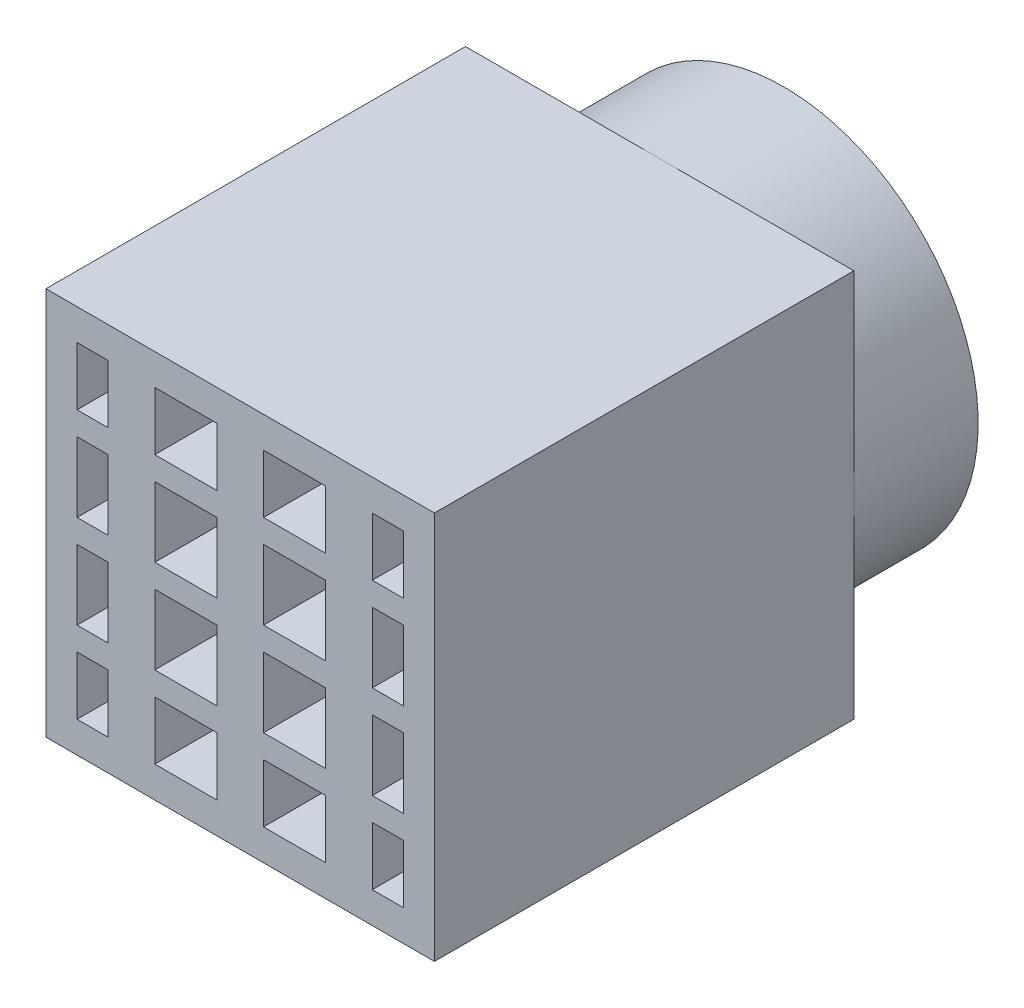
ISO-10303-21;
HEADER;
FILE_DESCRIPTION(('STEP AP214'),'2;1');
FILE_NAME('part.step','',(''),(''),'','','');
FILE_SCHEMA(('AUTOMOTIVE_DESIGN { 1 0 10303 214 1 1 1 1 }'));
ENDSEC;
DATA;
#1=APPLICATION_CONTEXT('core data for automotive mechanical design processes');
#2=APPLICATION_PROTOCOL_DEFINITION('international standard','automotive_design',2000,#1);
#3=PRODUCT_CONTEXT('',#1,'mechanical');
#4=PRODUCT('Part','Part','',(#3));
#5=PRODUCT_RELATED_PRODUCT_CATEGORY('part','',(#4));
#6=PRODUCT_DEFINITION_FORMATION('','',#4);
#7=PRODUCT_DEFINITION_CONTEXT('part definition',#1,'design');
#8=PRODUCT_DEFINITION('design','',#6,#7);
#9=PRODUCT_DEFINITION_SHAPE('','',#8);
#10=(LENGTH_UNIT() NAMED_UNIT(*) SI_UNIT(.MILLI.,.METRE.));
#11=(NAMED_UNIT(*) PLANE_ANGLE_UNIT() SI_UNIT($,.RADIAN.));
#12=(NAMED_UNIT(*) SI_UNIT($,.STERADIAN.) SOLID_ANGLE_UNIT());
#13=UNCERTAINTY_MEASURE_WITH_UNIT(LENGTH_MEASURE(1.E-05),#10,'distance_accuracy_value','');
#14=(GEOMETRIC_REPRESENTATION_CONTEXT(3) GLOBAL_UNCERTAINTY_ASSIGNED_CONTEXT((#13)) GLOBAL_UNIT_ASSIGNED_CONTEXT((#10,
#11,#12)) REPRESENTATION_CONTEXT('',''));
#15=CARTESIAN_POINT('',(0.,0.,0.));
#16=DIRECTION('',(0.,0.,1.));
#17=DIRECTION('',(1.,0.,0.));
#18=AXIS2_PLACEMENT_3D('',#15,#16,#17);
#19=CARTESIAN_POINT('',(0.,0.,-2.));
#20=DIRECTION('',(0.,0.,1.));
#21=DIRECTION('',(1.,0.,0.));
#22=AXIS2_PLACEMENT_3D('',#19,#20,#21);
#23=PLANE('',#22);
#24=CARTESIAN_POINT('',(0.,0.,-2.));
#25=DIRECTION('',(0.,0.,-1.));
#26=DIRECTION('',(-1.,0.,0.));
#27=AXIS2_PLACEMENT_3D('',#24,#25,#26);
#28=CIRCLE('',#27,12.5);
#29=CARTESIAN_POINT('',(-12.5,0.,-2.));
#30=VERTEX_POINT('',#29);
#31=CARTESIAN_POINT('',(0.,12.5,-2.));
#32=VERTEX_POINT('',#31);
#33=EDGE_CURVE('E52',#30,#32,#28,.T.);
#34=ORIENTED_EDGE('',*,*,#33,.F.);
#35=DIRECTION('',(0.,1.,0.));
#36=VECTOR('',#35,1.);
#37=CARTESIAN_POINT('',(-12.5,-12.5,-2.));
#38=LINE('',#37,#36);
#39=CARTESIAN_POINT('',(-12.5,12.5,-2.));
#40=VERTEX_POINT('',#39);
#41=EDGE_CURVE('E487',#30,#40,#38,.T.);
#42=ORIENTED_EDGE('',*,*,#41,.T.);
#43=DIRECTION('',(1.,0.,0.));
#44=VECTOR('',#43,1.);
#45=CARTESIAN_POINT('',(12.5,12.5,-2.));
#46=LINE('',#45,#44);
#47=EDGE_CURVE('E500',#40,#32,#46,.T.);
#48=ORIENTED_EDGE('',*,*,#47,.T.);
#49=EDGE_LOOP('',(#34,#42,#48));
#50=FACE_BOUND('',#49,.T.);
#51=ADVANCED_FACE('F40',(#50),#23,.F.);
#52=CARTESIAN_POINT('',(12.5,0.,-2.));
#53=VERTEX_POINT('',#52);
#54=EDGE_CURVE('E11',#32,#53,#28,.T.);
#55=ORIENTED_EDGE('',*,*,#54,.F.);
#56=CARTESIAN_POINT('',(12.5,12.5,-2.));
#57=VERTEX_POINT('',#56);
#58=EDGE_CURVE('E486',#32,#57,#46,.T.);
#59=ORIENTED_EDGE('',*,*,#58,.T.);
#60=DIRECTION('',(0.,-1.,0.));
#61=VECTOR('',#60,1.);
#62=CARTESIAN_POINT('',(12.5,-12.5,-2.));
#63=LINE('',#62,#61);
#64=EDGE_CURVE('E715',#57,#53,#63,.T.);
#65=ORIENTED_EDGE('',*,*,#64,.T.);
#66=EDGE_LOOP('',(#55,#59,#65));
#67=FACE_BOUND('',#66,.T.);
#68=ADVANCED_FACE('F1093',(#67),#23,.F.);
#69=CARTESIAN_POINT('',(0.,-12.5,-2.));
#70=VERTEX_POINT('',#69);
#71=EDGE_CURVE('E50',#53,#70,#28,.T.);
#72=ORIENTED_EDGE('',*,*,#71,.F.);
#73=CARTESIAN_POINT('',(12.5,-12.5,-2.));
#74=VERTEX_POINT('',#73);
#75=EDGE_CURVE('E714',#53,#74,#63,.T.);
#76=ORIENTED_EDGE('',*,*,#75,.T.);
#77=DIRECTION('',(-1.,0.,0.));
#78=VECTOR('',#77,1.);
#79=CARTESIAN_POINT('',(12.5,-12.5,-2.));
#80=LINE('',#79,#78);
#81=EDGE_CURVE('E718',#74,#70,#80,.T.);
#82=ORIENTED_EDGE('',*,*,#81,.T.);
#83=EDGE_LOOP('',(#72,#76,#82));
#84=FACE_BOUND('',#83,.T.);
#85=ADVANCED_FACE('F1097',(#84),#23,.F.);
#86=CARTESIAN_POINT('',(-1.5,-10.5,25.));
#87=DIRECTION('',(-1.,0.,0.));
#88=DIRECTION('',(0.,0.,1.));
#89=AXIS2_PLACEMENT_3D('',#86,#87,#88);
#90=PLANE('',#89);
#91=DIRECTION('',(0.,0.,-1.));
#92=VECTOR('',#91,1.);
#93=CARTESIAN_POINT('',(-1.5,6.75,25.));
#94=LINE('',#93,#92);
#95=CARTESIAN_POINT('',(-1.5,6.75,25.));
#96=VERTEX_POINT('',#95);
#97=CARTESIAN_POINT('',(-1.5,6.75,0.));
#98=VERTEX_POINT('',#97);
#99=EDGE_CURVE('E575',#96,#98,#94,.T.);
#100=ORIENTED_EDGE('',*,*,#99,.F.);
#101=DIRECTION('',(0.,1.,0.));
#102=VECTOR('',#101,1.);
#103=CARTESIAN_POINT('',(-1.5,-10.5,25.));
#104=LINE('',#103,#102);
#105=CARTESIAN_POINT('',(-1.5,10.5,25.));
#106=VERTEX_POINT('',#105);
#107=EDGE_CURVE('E854',#96,#106,#104,.T.);
#108=ORIENTED_EDGE('',*,*,#107,.T.);
#109=DIRECTION('',(0.,0.,-1.));
#110=VECTOR('',#109,1.);
#111=CARTESIAN_POINT('',(-1.5,10.5,25.));
#112=LINE('',#111,#110);
#113=CARTESIAN_POINT('',(-1.5,10.5,0.));
#114=VERTEX_POINT('',#113);
#115=EDGE_CURVE('E889',#106,#114,#112,.T.);
#116=ORIENTED_EDGE('',*,*,#115,.T.);
#117=DIRECTION('',(0.,1.,0.));
#118=VECTOR('',#117,1.);
#119=CARTESIAN_POINT('',(-1.5,-10.5,0.));
#120=LINE('',#119,#118);
#121=EDGE_CURVE('E849',#98,#114,#120,.T.);
#122=ORIENTED_EDGE('',*,*,#121,.F.);
#123=EDGE_LOOP('',(#100,#108,#116,#122));
#124=FACE_BOUND('',#123,.T.);
#125=ADVANCED_FACE('F940',(#124),#90,.T.);
#126=CARTESIAN_POINT('',(-5.5,-10.5,25.));
#127=DIRECTION('',(1.,0.,0.));
#128=DIRECTION('',(0.,0.,-1.));
#129=AXIS2_PLACEMENT_3D('',#126,#127,#128);
#130=PLANE('',#129);
#131=DIRECTION('',(0.,0.,1.));
#132=VECTOR('',#131,1.);
#133=CARTESIAN_POINT('',(-5.5,6.75,25.));
#134=LINE('',#133,#132);
#135=CARTESIAN_POINT('',(-5.5,6.75,0.));
#136=VERTEX_POINT('',#135);
#137=CARTESIAN_POINT('',(-5.5,6.75,25.));
#138=VERTEX_POINT('',#137);
#139=EDGE_CURVE('E572',#136,#138,#134,.T.);
#140=ORIENTED_EDGE('',*,*,#139,.F.);
#141=DIRECTION('',(0.,-1.,0.));
#142=VECTOR('',#141,1.);
#143=CARTESIAN_POINT('',(-5.5,-10.5,0.));
#144=LINE('',#143,#142);
#145=CARTESIAN_POINT('',(-5.5,10.5,0.));
#146=VERTEX_POINT('',#145);
#147=EDGE_CURVE('E874',#146,#136,#144,.T.);
#148=ORIENTED_EDGE('',*,*,#147,.F.);
#149=DIRECTION('',(0.,0.,-1.));
#150=VECTOR('',#149,1.);
#151=CARTESIAN_POINT('',(-5.5,10.5,25.));
#152=LINE('',#151,#150);
#153=CARTESIAN_POINT('',(-5.5,10.5,25.));
#154=VERTEX_POINT('',#153);
#155=EDGE_CURVE('E887',#154,#146,#152,.T.);
#156=ORIENTED_EDGE('',*,*,#155,.F.);
#157=DIRECTION('',(0.,-1.,0.));
#158=VECTOR('',#157,1.);
#159=CARTESIAN_POINT('',(-5.5,-10.5,25.));
#160=LINE('',#159,#158);
#161=EDGE_CURVE('E858',#154,#138,#160,.T.);
#162=ORIENTED_EDGE('',*,*,#161,.T.);
#163=EDGE_LOOP('',(#140,#148,#156,#162));
#164=FACE_BOUND('',#163,.T.);
#165=ADVANCED_FACE('F1128',(#164),#130,.T.);
#166=CARTESIAN_POINT('',(-8.5,-10.5,25.));
#167=DIRECTION('',(-1.,0.,0.));
#168=DIRECTION('',(0.,0.,1.));
#169=AXIS2_PLACEMENT_3D('',#166,#167,#168);
#170=PLANE('',#169);
#171=DIRECTION('',(0.,0.,-1.));
#172=VECTOR('',#171,1.);
#173=CARTESIAN_POINT('',(-8.5,6.75,25.));
#174=LINE('',#173,#172);
#175=CARTESIAN_POINT('',(-8.5,6.74999999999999,25.));
#176=VERTEX_POINT('',#175);
#177=CARTESIAN_POINT('',(-8.5,6.74999999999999,0.));
#178=VERTEX_POINT('',#177);
#179=EDGE_CURVE('E569',#176,#178,#174,.T.);
#180=ORIENTED_EDGE('',*,*,#179,.F.);
#181=DIRECTION('',(0.,1.,0.));
#182=VECTOR('',#181,1.);
#183=CARTESIAN_POINT('',(-8.5,-10.5,25.));
#184=LINE('',#183,#182);
#185=CARTESIAN_POINT('',(-8.5,10.5,25.));
#186=VERTEX_POINT('',#185);
#187=EDGE_CURVE('E811',#176,#186,#184,.T.);
#188=ORIENTED_EDGE('',*,*,#187,.T.);
#189=DIRECTION('',(0.,0.,-1.));
#190=VECTOR('',#189,1.);
#191=CARTESIAN_POINT('',(-8.5,10.5,25.));
#192=LINE('',#191,#190);
#193=CARTESIAN_POINT('',(-8.5,10.5,0.));
#194=VERTEX_POINT('',#193);
#195=EDGE_CURVE('E846',#186,#194,#192,.T.);
#196=ORIENTED_EDGE('',*,*,#195,.T.);
#197=DIRECTION('',(0.,1.,0.));
#198=VECTOR('',#197,1.);
#199=CARTESIAN_POINT('',(-8.5,-10.5,0.));
#200=LINE('',#199,#198);
#201=EDGE_CURVE('E806',#178,#194,#200,.T.);
#202=ORIENTED_EDGE('',*,*,#201,.F.);
#203=EDGE_LOOP('',(#180,#188,#196,#202));
#204=FACE_BOUND('',#203,.T.);
#205=ADVANCED_FACE('F1134',(#204),#170,.T.);
#206=CARTESIAN_POINT('',(-10.5,-10.5,25.));
#207=DIRECTION('',(1.,0.,0.));
#208=DIRECTION('',(0.,0.,-1.));
#209=AXIS2_PLACEMENT_3D('',#206,#207,#208);
#210=PLANE('',#209);
#211=DIRECTION('',(0.,0.,1.));
#212=VECTOR('',#211,1.);
#213=CARTESIAN_POINT('',(-10.5,6.75,25.));
#214=LINE('',#213,#212);
#215=CARTESIAN_POINT('',(-10.5,6.75,0.));
#216=VERTEX_POINT('',#215);
#217=CARTESIAN_POINT('',(-10.5,6.75,25.));
#218=VERTEX_POINT('',#217);
#219=EDGE_CURVE('E566',#216,#218,#214,.T.);
#220=ORIENTED_EDGE('',*,*,#219,.F.);
#221=DIRECTION('',(0.,-1.,0.));
#222=VECTOR('',#221,1.);
#223=CARTESIAN_POINT('',(-10.5,-10.5,0.));
#224=LINE('',#223,#222);
#225=CARTESIAN_POINT('',(-10.5,10.5,0.));
#226=VERTEX_POINT('',#225);
#227=EDGE_CURVE('E831',#226,#216,#224,.T.);
#228=ORIENTED_EDGE('',*,*,#227,.F.);
#229=DIRECTION('',(0.,0.,-1.));
#230=VECTOR('',#229,1.);
#231=CARTESIAN_POINT('',(-10.5,10.5,25.));
#232=LINE('',#231,#230);
#233=CARTESIAN_POINT('',(-10.5,10.5,25.));
#234=VERTEX_POINT('',#233);
#235=EDGE_CURVE('E844',#234,#226,#232,.T.);
#236=ORIENTED_EDGE('',*,*,#235,.F.);
#237=DIRECTION('',(0.,-1.,0.));
#238=VECTOR('',#237,1.);
#239=CARTESIAN_POINT('',(-10.5,-10.5,25.));
#240=LINE('',#239,#238);
#241=EDGE_CURVE('E815',#234,#218,#240,.T.);
#242=ORIENTED_EDGE('',*,*,#241,.T.);
#243=EDGE_LOOP('',(#220,#228,#236,#242));
#244=FACE_BOUND('',#243,.T.);
#245=ADVANCED_FACE('F1227',(#244),#210,.T.);
#246=CARTESIAN_POINT('',(5.5,-10.5,25.));
#247=DIRECTION('',(-1.,0.,0.));
#248=DIRECTION('',(0.,-1.,0.));
#249=AXIS2_PLACEMENT_3D('',#246,#247,#248);
#250=PLANE('',#249);
#251=DIRECTION('',(0.,0.,-1.));
#252=VECTOR('',#251,1.);
#253=CARTESIAN_POINT('',(5.5,6.75,25.));
#254=LINE('',#253,#252);
#255=CARTESIAN_POINT('',(5.5,6.75,25.));
#256=VERTEX_POINT('',#255);
#257=CARTESIAN_POINT('',(5.5,6.75,0.));
#258=VERTEX_POINT('',#257);
#259=EDGE_CURVE('E563',#256,#258,#254,.T.);
#260=ORIENTED_EDGE('',*,*,#259,.F.);
#261=DIRECTION('',(0.,1.,0.));
#262=VECTOR('',#261,1.);
#263=CARTESIAN_POINT('',(5.5,-10.5,25.));
#264=LINE('',#263,#262);
#265=CARTESIAN_POINT('',(5.5,10.5,25.));
#266=VERTEX_POINT('',#265);
#267=EDGE_CURVE('E768',#256,#266,#264,.T.);
#268=ORIENTED_EDGE('',*,*,#267,.T.);
#269=DIRECTION('',(0.,0.,-1.));
#270=VECTOR('',#269,1.);
#271=CARTESIAN_POINT('',(5.5,10.5,25.));
#272=LINE('',#271,#270);
#273=CARTESIAN_POINT('',(5.5,10.5,0.));
#274=VERTEX_POINT('',#273);
#275=EDGE_CURVE('E803',#266,#274,#272,.T.);
#276=ORIENTED_EDGE('',*,*,#275,.T.);
#277=DIRECTION('',(0.,1.,0.));
#278=VECTOR('',#277,1.);
#279=CARTESIAN_POINT('',(5.5,-10.5,0.));
#280=LINE('',#279,#278);
#281=EDGE_CURVE('E763',#258,#274,#280,.T.);
#282=ORIENTED_EDGE('',*,*,#281,.F.);
#283=EDGE_LOOP('',(#260,#268,#276,#282));
#284=FACE_BOUND('',#283,.T.);
#285=ADVANCED_FACE('F972',(#284),#250,.T.);
#286=CARTESIAN_POINT('',(1.5,-10.5,25.));
#287=DIRECTION('',(1.,0.,0.));
#288=DIRECTION('',(0.,1.,0.));
#289=AXIS2_PLACEMENT_3D('',#286,#287,#288);
#290=PLANE('',#289);
#291=DIRECTION('',(0.,0.,1.));
#292=VECTOR('',#291,1.);
#293=CARTESIAN_POINT('',(1.5,6.75,25.));
#294=LINE('',#293,#292);
#295=CARTESIAN_POINT('',(1.5,6.75,0.));
#296=VERTEX_POINT('',#295);
#297=CARTESIAN_POINT('',(1.5,6.75,25.));
#298=VERTEX_POINT('',#297);
#299=EDGE_CURVE('E560',#296,#298,#294,.T.);
#300=ORIENTED_EDGE('',*,*,#299,.F.);
#301=DIRECTION('',(0.,-1.,0.));
#302=VECTOR('',#301,1.);
#303=CARTESIAN_POINT('',(1.5,-10.5,0.));
#304=LINE('',#303,#302);
#305=CARTESIAN_POINT('',(1.5,10.5,0.));
#306=VERTEX_POINT('',#305);
#307=EDGE_CURVE('E788',#306,#296,#304,.T.);
#308=ORIENTED_EDGE('',*,*,#307,.F.);
#309=DIRECTION('',(0.,0.,-1.));
#310=VECTOR('',#309,1.);
#311=CARTESIAN_POINT('',(1.5,10.5,25.));
#312=LINE('',#311,#310);
#313=CARTESIAN_POINT('',(1.5,10.5,25.));
#314=VERTEX_POINT('',#313);
#315=EDGE_CURVE('E801',#314,#306,#312,.T.);
#316=ORIENTED_EDGE('',*,*,#315,.F.);
#317=DIRECTION('',(0.,-1.,0.));
#318=VECTOR('',#317,1.);
#319=CARTESIAN_POINT('',(1.5,-10.5,25.));
#320=LINE('',#319,#318);
#321=EDGE_CURVE('E772',#314,#298,#320,.T.);
#322=ORIENTED_EDGE('',*,*,#321,.T.);
#323=EDGE_LOOP('',(#300,#308,#316,#322));
#324=FACE_BOUND('',#323,.T.);
#325=ADVANCED_FACE('F986',(#324),#290,.T.);
#326=CARTESIAN_POINT('',(10.5,-10.5,25.));
#327=DIRECTION('',(-1.,0.,0.));
#328=DIRECTION('',(0.,-1.,0.));
#329=AXIS2_PLACEMENT_3D('',#326,#327,#328);
#330=PLANE('',#329);
#331=DIRECTION('',(0.,0.,-1.));
#332=VECTOR('',#331,1.);
#333=CARTESIAN_POINT('',(10.5,6.75,25.));
#334=LINE('',#333,#332);
#335=CARTESIAN_POINT('',(10.5,6.75,25.));
#336=VERTEX_POINT('',#335);
#337=CARTESIAN_POINT('',(10.5,6.75,0.));
#338=VERTEX_POINT('',#337);
#339=EDGE_CURVE('E557',#336,#338,#334,.T.);
#340=ORIENTED_EDGE('',*,*,#339,.F.);
#341=DIRECTION('',(0.,1.,0.));
#342=VECTOR('',#341,1.);
#343=CARTESIAN_POINT('',(10.5,-10.5,25.));
#344=LINE('',#343,#342);
#345=CARTESIAN_POINT('',(10.5,10.5,25.));
#346=VERTEX_POINT('',#345);
#347=EDGE_CURVE('E725',#336,#346,#344,.T.);
#348=ORIENTED_EDGE('',*,*,#347,.T.);
#349=DIRECTION('',(0.,0.,-1.));
#350=VECTOR('',#349,1.);
#351=CARTESIAN_POINT('',(10.5,10.5,25.));
#352=LINE('',#351,#350);
#353=CARTESIAN_POINT('',(10.5,10.5,0.));
#354=VERTEX_POINT('',#353);
#355=EDGE_CURVE('E760',#346,#354,#352,.T.);
#356=ORIENTED_EDGE('',*,*,#355,.T.);
#357=DIRECTION('',(0.,1.,0.));
#358=VECTOR('',#357,1.);
#359=CARTESIAN_POINT('',(10.5,-10.5,0.));
#360=LINE('',#359,#358);
#361=EDGE_CURVE('E720',#338,#354,#360,.T.);
#362=ORIENTED_EDGE('',*,*,#361,.F.);
#363=EDGE_LOOP('',(#340,#348,#356,#362));
#364=FACE_BOUND('',#363,.T.);
#365=ADVANCED_FACE('F1017',(#364),#330,.T.);
#366=CARTESIAN_POINT('',(8.5,-10.5,25.));
#367=DIRECTION('',(1.,0.,0.));
#368=DIRECTION('',(0.,1.,0.));
#369=AXIS2_PLACEMENT_3D('',#366,#367,#368);
#370=PLANE('',#369);
#371=DIRECTION('',(0.,0.,1.));
#372=VECTOR('',#371,1.);
#373=CARTESIAN_POINT('',(8.5,6.75,25.));
#374=LINE('',#373,#372);
#375=CARTESIAN_POINT('',(8.5,6.74999999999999,0.));
#376=VERTEX_POINT('',#375);
#377=CARTESIAN_POINT('',(8.5,6.74999999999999,25.));
#378=VERTEX_POINT('',#377);
#379=EDGE_CURVE('E554',#376,#378,#374,.T.);
#380=ORIENTED_EDGE('',*,*,#379,.F.);
#381=DIRECTION('',(0.,-1.,0.));
#382=VECTOR('',#381,1.);
#383=CARTESIAN_POINT('',(8.5,-10.5,0.));
#384=LINE('',#383,#382);
#385=CARTESIAN_POINT('',(8.5,10.5,0.));
#386=VERTEX_POINT('',#385);
#387=EDGE_CURVE('E745',#386,#376,#384,.T.);
#388=ORIENTED_EDGE('',*,*,#387,.F.);
#389=DIRECTION('',(0.,0.,-1.));
#390=VECTOR('',#389,1.);
#391=CARTESIAN_POINT('',(8.5,10.5,25.));
#392=LINE('',#391,#390);
#393=CARTESIAN_POINT('',(8.5,10.5,25.));
#394=VERTEX_POINT('',#393);
#395=EDGE_CURVE('E758',#394,#386,#392,.T.);
#396=ORIENTED_EDGE('',*,*,#395,.F.);
#397=DIRECTION('',(0.,-1.,0.));
#398=VECTOR('',#397,1.);
#399=CARTESIAN_POINT('',(8.5,-10.5,25.));
#400=LINE('',#399,#398);
#401=EDGE_CURVE('E729',#394,#378,#400,.T.);
#402=ORIENTED_EDGE('',*,*,#401,.T.);
#403=EDGE_LOOP('',(#380,#388,#396,#402));
#404=FACE_BOUND('',#403,.T.);
#405=ADVANCED_FACE('F1007',(#404),#370,.T.);
#406=CARTESIAN_POINT('',(0.,0.,0.));
#407=DIRECTION('',(0.,0.,1.));
#408=DIRECTION('',(1.,0.,0.));
#409=AXIS2_PLACEMENT_3D('',#406,#407,#408);
#410=PLANE('',#409);
#411=DIRECTION('',(-1.,0.,0.));
#412=VECTOR('',#411,1.);
#413=CARTESIAN_POINT('',(12.5,6.75,0.));
#414=LINE('',#413,#412);
#415=EDGE_CURVE('E521',#338,#376,#414,.T.);
#416=ORIENTED_EDGE('',*,*,#415,.F.);
#417=ORIENTED_EDGE('',*,*,#361,.T.);
#418=DIRECTION('',(-1.,0.,0.));
#419=VECTOR('',#418,1.);
#420=CARTESIAN_POINT('',(10.5,10.5,0.));
#421=LINE('',#420,#419);
#422=EDGE_CURVE('E739',#354,#386,#421,.T.);
#423=ORIENTED_EDGE('',*,*,#422,.T.);
#424=ORIENTED_EDGE('',*,*,#387,.T.);
#425=EDGE_LOOP('',(#416,#417,#423,#424));
#426=FACE_BOUND('',#425,.T.);
#427=ADVANCED_FACE('F1010',(#426),#410,.T.);
#428=EDGE_CURVE('E991',#258,#296,#414,.T.);
#429=ORIENTED_EDGE('',*,*,#428,.F.);
#430=ORIENTED_EDGE('',*,*,#281,.T.);
#431=DIRECTION('',(-1.,0.,0.));
#432=VECTOR('',#431,1.);
#433=CARTESIAN_POINT('',(5.5,10.5,0.));
#434=LINE('',#433,#432);
#435=EDGE_CURVE('E782',#274,#306,#434,.T.);
#436=ORIENTED_EDGE('',*,*,#435,.T.);
#437=ORIENTED_EDGE('',*,*,#307,.T.);
#438=EDGE_LOOP('',(#429,#430,#436,#437));
#439=FACE_BOUND('',#438,.T.);
#440=ADVANCED_FACE('F1080',(#439),#410,.T.);
#441=EDGE_CURVE('E517',#178,#216,#414,.T.);
#442=ORIENTED_EDGE('',*,*,#441,.F.);
#443=ORIENTED_EDGE('',*,*,#201,.T.);
#444=DIRECTION('',(-1.,0.,0.));
#445=VECTOR('',#444,1.);
#446=CARTESIAN_POINT('',(-10.5,10.5,0.));
#447=LINE('',#446,#445);
#448=EDGE_CURVE('E825',#194,#226,#447,.T.);
#449=ORIENTED_EDGE('',*,*,#448,.T.);
#450=ORIENTED_EDGE('',*,*,#227,.T.);
#451=EDGE_LOOP('',(#442,#443,#449,#450));
#452=FACE_BOUND('',#451,.T.);
#453=ADVANCED_FACE('F1082',(#452),#410,.T.);
#454=EDGE_CURVE('E520',#98,#136,#414,.T.);
#455=ORIENTED_EDGE('',*,*,#454,.F.);
#456=ORIENTED_EDGE('',*,*,#121,.T.);
#457=DIRECTION('',(-1.,0.,0.));
#458=VECTOR('',#457,1.);
#459=CARTESIAN_POINT('',(-5.5,10.5,0.));
#460=LINE('',#459,#458);
#461=EDGE_CURVE('E868',#114,#146,#460,.T.);
#462=ORIENTED_EDGE('',*,*,#461,.T.);
#463=ORIENTED_EDGE('',*,*,#147,.T.);
#464=EDGE_LOOP('',(#455,#456,#462,#463));
#465=FACE_BOUND('',#464,.T.);
#466=ADVANCED_FACE('F931',(#465),#410,.T.);
#467=DIRECTION('',(0.,0.,1.));
#468=VECTOR('',#467,1.);
#469=CARTESIAN_POINT('',(-1.5,-6.75,25.));
#470=LINE('',#469,#468);
#471=CARTESIAN_POINT('',(-1.5,-6.75,0.));
#472=VERTEX_POINT('',#471);
#473=CARTESIAN_POINT('',(-1.5,-6.75,25.));
#474=VERTEX_POINT('',#473);
#475=EDGE_CURVE('E643',#472,#474,#470,.T.);
#476=ORIENTED_EDGE('',*,*,#475,.F.);
#477=CARTESIAN_POINT('',(-1.5,-10.5,0.));
#478=VERTEX_POINT('',#477);
#479=EDGE_CURVE('E865',#478,#472,#120,.T.);
#480=ORIENTED_EDGE('',*,*,#479,.F.);
#481=DIRECTION('',(0.,0.,-1.));
#482=VECTOR('',#481,1.);
#483=CARTESIAN_POINT('',(-1.5,-10.5,25.));
#484=LINE('',#483,#482);
#485=CARTESIAN_POINT('',(-1.5,-10.5,25.));
#486=VERTEX_POINT('',#485);
#487=EDGE_CURVE('E864',#486,#478,#484,.T.);
#488=ORIENTED_EDGE('',*,*,#487,.F.);
#489=EDGE_CURVE('E850',#486,#474,#104,.T.);
#490=ORIENTED_EDGE('',*,*,#489,.T.);
#491=EDGE_LOOP('',(#476,#480,#488,#490));
#492=FACE_BOUND('',#491,.T.);
#493=ADVANCED_FACE('F1130',(#492),#90,.T.);
#494=DIRECTION('',(0.,0.,-1.));
#495=VECTOR('',#494,1.);
#496=CARTESIAN_POINT('',(-5.5,-6.75,25.));
#497=LINE('',#496,#495);
#498=CARTESIAN_POINT('',(-5.5,-6.75,25.));
#499=VERTEX_POINT('',#498);
#500=CARTESIAN_POINT('',(-5.5,-6.75,0.));
#501=VERTEX_POINT('',#500);
#502=EDGE_CURVE('E640',#499,#501,#497,.T.);
#503=ORIENTED_EDGE('',*,*,#502,.F.);
#504=CARTESIAN_POINT('',(-5.5,-10.5,25.));
#505=VERTEX_POINT('',#504);
#506=EDGE_CURVE('E857',#499,#505,#160,.T.);
#507=ORIENTED_EDGE('',*,*,#506,.T.);
#508=DIRECTION('',(0.,0.,-1.));
#509=VECTOR('',#508,1.);
#510=CARTESIAN_POINT('',(-5.5,-10.5,25.));
#511=LINE('',#510,#509);
#512=CARTESIAN_POINT('',(-5.5,-10.5,0.));
#513=VERTEX_POINT('',#512);
#514=EDGE_CURVE('E884',#505,#513,#511,.T.);
#515=ORIENTED_EDGE('',*,*,#514,.T.);
#516=EDGE_CURVE('E873',#501,#513,#144,.T.);
#517=ORIENTED_EDGE('',*,*,#516,.F.);
#518=EDGE_LOOP('',(#503,#507,#515,#517));
#519=FACE_BOUND('',#518,.T.);
#520=ADVANCED_FACE('F1137',(#519),#130,.T.);
#521=DIRECTION('',(0.,0.,1.));
#522=VECTOR('',#521,1.);
#523=CARTESIAN_POINT('',(-8.5,-6.75,25.));
#524=LINE('',#523,#522);
#525=CARTESIAN_POINT('',(-8.5,-6.75,0.));
#526=VERTEX_POINT('',#525);
#527=CARTESIAN_POINT('',(-8.5,-6.75,25.));
#528=VERTEX_POINT('',#527);
#529=EDGE_CURVE('E637',#526,#528,#524,.T.);
#530=ORIENTED_EDGE('',*,*,#529,.F.);
#531=CARTESIAN_POINT('',(-8.5,-10.5,0.));
#532=VERTEX_POINT('',#531);
#533=EDGE_CURVE('E822',#532,#526,#200,.T.);
#534=ORIENTED_EDGE('',*,*,#533,.F.);
#535=DIRECTION('',(0.,0.,-1.));
#536=VECTOR('',#535,1.);
#537=CARTESIAN_POINT('',(-8.5,-10.5,25.));
#538=LINE('',#537,#536);
#539=CARTESIAN_POINT('',(-8.5,-10.5,25.));
#540=VERTEX_POINT('',#539);
#541=EDGE_CURVE('E821',#540,#532,#538,.T.);
#542=ORIENTED_EDGE('',*,*,#541,.F.);
#543=EDGE_CURVE('E807',#540,#528,#184,.T.);
#544=ORIENTED_EDGE('',*,*,#543,.T.);
#545=EDGE_LOOP('',(#530,#534,#542,#544));
#546=FACE_BOUND('',#545,.T.);
#547=ADVANCED_FACE('F1263',(#546),#170,.T.);
#548=DIRECTION('',(0.,0.,-1.));
#549=VECTOR('',#548,1.);
#550=CARTESIAN_POINT('',(-10.5,-6.75,25.));
#551=LINE('',#550,#549);
#552=CARTESIAN_POINT('',(-10.5,-6.75,25.));
#553=VERTEX_POINT('',#552);
#554=CARTESIAN_POINT('',(-10.5,-6.75,0.));
#555=VERTEX_POINT('',#554);
#556=EDGE_CURVE('E634',#553,#555,#551,.T.);
#557=ORIENTED_EDGE('',*,*,#556,.F.);
#558=CARTESIAN_POINT('',(-10.5,-10.5,25.));
#559=VERTEX_POINT('',#558);
#560=EDGE_CURVE('E814',#553,#559,#240,.T.);
#561=ORIENTED_EDGE('',*,*,#560,.T.);
#562=DIRECTION('',(0.,0.,-1.));
#563=VECTOR('',#562,1.);
#564=CARTESIAN_POINT('',(-10.5,-10.5,25.));
#565=LINE('',#564,#563);
#566=CARTESIAN_POINT('',(-10.5,-10.5,0.));
#567=VERTEX_POINT('',#566);
#568=EDGE_CURVE('E841',#559,#567,#565,.T.);
#569=ORIENTED_EDGE('',*,*,#568,.T.);
#570=EDGE_CURVE('E830',#555,#567,#224,.T.);
#571=ORIENTED_EDGE('',*,*,#570,.F.);
#572=EDGE_LOOP('',(#557,#561,#569,#571));
#573=FACE_BOUND('',#572,.T.);
#574=ADVANCED_FACE('F1251',(#573),#210,.T.);
#575=DIRECTION('',(0.,0.,1.));
#576=VECTOR('',#575,1.);
#577=CARTESIAN_POINT('',(5.5,-6.75,25.));
#578=LINE('',#577,#576);
#579=CARTESIAN_POINT('',(5.5,-6.75,0.));
#580=VERTEX_POINT('',#579);
#581=CARTESIAN_POINT('',(5.5,-6.75,25.));
#582=VERTEX_POINT('',#581);
#583=EDGE_CURVE('E631',#580,#582,#578,.T.);
#584=ORIENTED_EDGE('',*,*,#583,.F.);
#585=CARTESIAN_POINT('',(5.5,-10.5,0.));
#586=VERTEX_POINT('',#585);
#587=EDGE_CURVE('E779',#586,#580,#280,.T.);
#588=ORIENTED_EDGE('',*,*,#587,.F.);
#589=DIRECTION('',(0.,0.,-1.));
#590=VECTOR('',#589,1.);
#591=CARTESIAN_POINT('',(5.5,-10.5,25.));
#592=LINE('',#591,#590);
#593=CARTESIAN_POINT('',(5.5,-10.5,25.));
#594=VERTEX_POINT('',#593);
#595=EDGE_CURVE('E778',#594,#586,#592,.T.);
#596=ORIENTED_EDGE('',*,*,#595,.F.);
#597=EDGE_CURVE('E764',#594,#582,#264,.T.);
#598=ORIENTED_EDGE('',*,*,#597,.T.);
#599=EDGE_LOOP('',(#584,#588,#596,#598));
#600=FACE_BOUND('',#599,.T.);
#601=ADVANCED_FACE('F1404',(#600),#250,.T.);
#602=DIRECTION('',(0.,0.,-1.));
#603=VECTOR('',#602,1.);
#604=CARTESIAN_POINT('',(1.5,-6.75,25.));
#605=LINE('',#604,#603);
#606=CARTESIAN_POINT('',(1.5,-6.75,25.));
#607=VERTEX_POINT('',#606);
#608=CARTESIAN_POINT('',(1.5,-6.75,0.));
#609=VERTEX_POINT('',#608);
#610=EDGE_CURVE('E628',#607,#609,#605,.T.);
#611=ORIENTED_EDGE('',*,*,#610,.F.);
#612=CARTESIAN_POINT('',(1.5,-10.5,25.));
#613=VERTEX_POINT('',#612);
#614=EDGE_CURVE('E771',#607,#613,#320,.T.);
#615=ORIENTED_EDGE('',*,*,#614,.T.);
#616=DIRECTION('',(0.,0.,-1.));
#617=VECTOR('',#616,1.);
#618=CARTESIAN_POINT('',(1.5,-10.5,25.));
#619=LINE('',#618,#617);
#620=CARTESIAN_POINT('',(1.5,-10.5,0.));
#621=VERTEX_POINT('',#620);
#622=EDGE_CURVE('E798',#613,#621,#619,.T.);
#623=ORIENTED_EDGE('',*,*,#622,.T.);
#624=EDGE_CURVE('E787',#609,#621,#304,.T.);
#625=ORIENTED_EDGE('',*,*,#624,.F.);
#626=EDGE_LOOP('',(#611,#615,#623,#625));
#627=FACE_BOUND('',#626,.T.);
#628=ADVANCED_FACE('F1194',(#627),#290,.T.);
#629=DIRECTION('',(0.,0.,1.));
#630=VECTOR('',#629,1.);
#631=CARTESIAN_POINT('',(10.5,-6.75,25.));
#632=LINE('',#631,#630);
#633=CARTESIAN_POINT('',(10.5,-6.75,0.));
#634=VERTEX_POINT('',#633);
#635=CARTESIAN_POINT('',(10.5,-6.75,25.));
#636=VERTEX_POINT('',#635);
#637=EDGE_CURVE('E625',#634,#636,#632,.T.);
#638=ORIENTED_EDGE('',*,*,#637,.F.);
#639=CARTESIAN_POINT('',(10.5,-10.5,0.));
#640=VERTEX_POINT('',#639);
#641=EDGE_CURVE('E736',#640,#634,#360,.T.);
#642=ORIENTED_EDGE('',*,*,#641,.F.);
#643=DIRECTION('',(0.,0.,-1.));
#644=VECTOR('',#643,1.);
#645=CARTESIAN_POINT('',(10.5,-10.5,25.));
#646=LINE('',#645,#644);
#647=CARTESIAN_POINT('',(10.5,-10.5,25.));
#648=VERTEX_POINT('',#647);
#649=EDGE_CURVE('E735',#648,#640,#646,.T.);
#650=ORIENTED_EDGE('',*,*,#649,.F.);
#651=EDGE_CURVE('E721',#648,#636,#344,.T.);
#652=ORIENTED_EDGE('',*,*,#651,.T.);
#653=EDGE_LOOP('',(#638,#642,#650,#652));
#654=FACE_BOUND('',#653,.T.);
#655=ADVANCED_FACE('F1047',(#654),#330,.T.);
#656=DIRECTION('',(0.,0.,-1.));
#657=VECTOR('',#656,1.);
#658=CARTESIAN_POINT('',(8.5,-6.75,25.));
#659=LINE('',#658,#657);
#660=CARTESIAN_POINT('',(8.5,-6.75,25.));
#661=VERTEX_POINT('',#660);
#662=CARTESIAN_POINT('',(8.5,-6.75,0.));
#663=VERTEX_POINT('',#662);
#664=EDGE_CURVE('E622',#661,#663,#659,.T.);
#665=ORIENTED_EDGE('',*,*,#664,.F.);
#666=CARTESIAN_POINT('',(8.5,-10.5,25.));
#667=VERTEX_POINT('',#666);
#668=EDGE_CURVE('E728',#661,#667,#400,.T.);
#669=ORIENTED_EDGE('',*,*,#668,.T.);
#670=DIRECTION('',(0.,0.,-1.));
#671=VECTOR('',#670,1.);
#672=CARTESIAN_POINT('',(8.5,-10.5,25.));
#673=LINE('',#672,#671);
#674=CARTESIAN_POINT('',(8.5,-10.5,0.));
#675=VERTEX_POINT('',#674);
#676=EDGE_CURVE('E755',#667,#675,#673,.T.);
#677=ORIENTED_EDGE('',*,*,#676,.T.);
#678=EDGE_CURVE('E744',#663,#675,#384,.T.);
#679=ORIENTED_EDGE('',*,*,#678,.F.);
#680=EDGE_LOOP('',(#665,#669,#677,#679));
#681=FACE_BOUND('',#680,.T.);
#682=ADVANCED_FACE('F1035',(#681),#370,.T.);
#683=DIRECTION('',(1.,0.,0.));
#684=VECTOR('',#683,1.);
#685=CARTESIAN_POINT('',(12.5,-6.75,0.));
#686=LINE('',#685,#684);
#687=EDGE_CURVE('E585',#663,#634,#686,.T.);
#688=ORIENTED_EDGE('',*,*,#687,.F.);
#689=ORIENTED_EDGE('',*,*,#678,.T.);
#690=DIRECTION('',(1.,0.,0.));
#691=VECTOR('',#690,1.);
#692=CARTESIAN_POINT('',(10.5,-10.5,0.));
#693=LINE('',#692,#691);
#694=EDGE_CURVE('E748',#675,#640,#693,.T.);
#695=ORIENTED_EDGE('',*,*,#694,.T.);
#696=ORIENTED_EDGE('',*,*,#641,.T.);
#697=EDGE_LOOP('',(#688,#689,#695,#696));
#698=FACE_BOUND('',#697,.T.);
#699=ADVANCED_FACE('F1051',(#698),#410,.T.);
#700=EDGE_CURVE('E588',#609,#580,#686,.T.);
#701=ORIENTED_EDGE('',*,*,#700,.F.);
#702=ORIENTED_EDGE('',*,*,#624,.T.);
#703=DIRECTION('',(1.,0.,0.));
#704=VECTOR('',#703,1.);
#705=CARTESIAN_POINT('',(5.5,-10.5,0.));
#706=LINE('',#705,#704);
#707=EDGE_CURVE('E791',#621,#586,#706,.T.);
#708=ORIENTED_EDGE('',*,*,#707,.T.);
#709=ORIENTED_EDGE('',*,*,#587,.T.);
#710=EDGE_LOOP('',(#701,#702,#708,#709));
#711=FACE_BOUND('',#710,.T.);
#712=ADVANCED_FACE('F1186',(#711),#410,.T.);
#713=EDGE_CURVE('E589',#555,#526,#686,.T.);
#714=ORIENTED_EDGE('',*,*,#713,.F.);
#715=ORIENTED_EDGE('',*,*,#570,.T.);
#716=DIRECTION('',(1.,0.,0.));
#717=VECTOR('',#716,1.);
#718=CARTESIAN_POINT('',(-10.5,-10.5,0.));
#719=LINE('',#718,#717);
#720=EDGE_CURVE('E834',#567,#532,#719,.T.);
#721=ORIENTED_EDGE('',*,*,#720,.T.);
#722=ORIENTED_EDGE('',*,*,#533,.T.);
#723=EDGE_LOOP('',(#714,#715,#721,#722));
#724=FACE_BOUND('',#723,.T.);
#725=ADVANCED_FACE('F1162',(#724),#410,.T.);
#726=DIRECTION('',(1.,0.,0.));
#727=VECTOR('',#726,1.);
#728=CARTESIAN_POINT('',(0.,-6.75,0.));
#729=LINE('',#728,#727);
#730=EDGE_CURVE('E44',#501,#472,#729,.T.);
#731=ORIENTED_EDGE('',*,*,#730,.F.);
#732=ORIENTED_EDGE('',*,*,#516,.T.);
#733=DIRECTION('',(1.,0.,0.));
#734=VECTOR('',#733,1.);
#735=CARTESIAN_POINT('',(-5.5,-10.5,0.));
#736=LINE('',#735,#734);
#737=EDGE_CURVE('E877',#513,#478,#736,.T.);
#738=ORIENTED_EDGE('',*,*,#737,.T.);
#739=ORIENTED_EDGE('',*,*,#479,.T.);
#740=EDGE_LOOP('',(#731,#732,#738,#739));
#741=FACE_BOUND('',#740,.T.);
#742=ADVANCED_FACE('F1154',(#741),#410,.T.);
#743=DIRECTION('',(0.,0.,1.));
#744=VECTOR('',#743,1.);
#745=CARTESIAN_POINT('',(-1.5,5.25,25.));
#746=LINE('',#745,#744);
#747=CARTESIAN_POINT('',(-1.5,5.25,0.));
#748=VERTEX_POINT('',#747);
#749=CARTESIAN_POINT('',(-1.5,5.25,25.));
#750=VERTEX_POINT('',#749);
#751=EDGE_CURVE('E551',#748,#750,#746,.T.);
#752=ORIENTED_EDGE('',*,*,#751,.F.);
#753=CARTESIAN_POINT('',(-1.5,0.750000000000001,0.));
#754=VERTEX_POINT('',#753);
#755=EDGE_CURVE('E870',#754,#748,#120,.T.);
#756=ORIENTED_EDGE('',*,*,#755,.F.);
#757=DIRECTION('',(0.,0.,-1.));
#758=VECTOR('',#757,1.);
#759=CARTESIAN_POINT('',(-1.5,0.750000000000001,25.));
#760=LINE('',#759,#758);
#761=CARTESIAN_POINT('',(-1.5,0.750000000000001,25.));
#762=VERTEX_POINT('',#761);
#763=EDGE_CURVE('E498',#762,#754,#760,.T.);
#764=ORIENTED_EDGE('',*,*,#763,.F.);
#765=EDGE_CURVE('E855',#762,#750,#104,.T.);
#766=ORIENTED_EDGE('',*,*,#765,.T.);
#767=EDGE_LOOP('',(#752,#756,#764,#766));
#768=FACE_BOUND('',#767,.T.);
#769=ADVANCED_FACE('F1143',(#768),#90,.T.);
#770=DIRECTION('',(0.,0.,-1.));
#771=VECTOR('',#770,1.);
#772=CARTESIAN_POINT('',(-5.5,5.25,25.));
#773=LINE('',#772,#771);
#774=CARTESIAN_POINT('',(-5.5,5.25,25.));
#775=VERTEX_POINT('',#774);
#776=CARTESIAN_POINT('',(-5.5,5.25,0.));
#777=VERTEX_POINT('',#776);
#778=EDGE_CURVE('E548',#775,#777,#773,.T.);
#779=ORIENTED_EDGE('',*,*,#778,.F.);
#780=CARTESIAN_POINT('',(-5.5,0.750000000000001,25.));
#781=VERTEX_POINT('',#780);
#782=EDGE_CURVE('E861',#775,#781,#160,.T.);
#783=ORIENTED_EDGE('',*,*,#782,.T.);
#784=DIRECTION('',(0.,0.,1.));
#785=VECTOR('',#784,1.);
#786=CARTESIAN_POINT('',(-5.5,0.750000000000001,25.));
#787=LINE('',#786,#785);
#788=CARTESIAN_POINT('',(-5.5,0.750000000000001,0.));
#789=VERTEX_POINT('',#788);
#790=EDGE_CURVE('E708',#789,#781,#787,.T.);
#791=ORIENTED_EDGE('',*,*,#790,.F.);
#792=EDGE_CURVE('E878',#777,#789,#144,.T.);
#793=ORIENTED_EDGE('',*,*,#792,.F.);
#794=EDGE_LOOP('',(#779,#783,#791,#793));
#795=FACE_BOUND('',#794,.T.);
#796=ADVANCED_FACE('F1153',(#795),#130,.T.);
#797=DIRECTION('',(0.,0.,1.));
#798=VECTOR('',#797,1.);
#799=CARTESIAN_POINT('',(-8.5,5.25,25.));
#800=LINE('',#799,#798);
#801=CARTESIAN_POINT('',(-8.49999999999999,5.25,0.));
#802=VERTEX_POINT('',#801);
#803=CARTESIAN_POINT('',(-8.5,5.24999999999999,25.));
#804=VERTEX_POINT('',#803);
#805=EDGE_CURVE('E545',#802,#804,#800,.T.);
#806=ORIENTED_EDGE('',*,*,#805,.F.);
#807=CARTESIAN_POINT('',(-8.5,0.749999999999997,0.));
#808=VERTEX_POINT('',#807);
#809=EDGE_CURVE('E827',#808,#802,#200,.T.);
#810=ORIENTED_EDGE('',*,*,#809,.F.);
#811=DIRECTION('',(0.,0.,-1.));
#812=VECTOR('',#811,1.);
#813=CARTESIAN_POINT('',(-8.5,0.750000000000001,25.));
#814=LINE('',#813,#812);
#815=CARTESIAN_POINT('',(-8.5,0.749999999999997,25.));
#816=VERTEX_POINT('',#815);
#817=EDGE_CURVE('E705',#816,#808,#814,.T.);
#818=ORIENTED_EDGE('',*,*,#817,.F.);
#819=EDGE_CURVE('E812',#816,#804,#184,.T.);
#820=ORIENTED_EDGE('',*,*,#819,.T.);
#821=EDGE_LOOP('',(#806,#810,#818,#820));
#822=FACE_BOUND('',#821,.T.);
#823=ADVANCED_FACE('F1160',(#822),#170,.T.);
#824=DIRECTION('',(0.,0.,-1.));
#825=VECTOR('',#824,1.);
#826=CARTESIAN_POINT('',(-10.5,5.25,25.));
#827=LINE('',#826,#825);
#828=CARTESIAN_POINT('',(-10.5,5.25,25.));
#829=VERTEX_POINT('',#828);
#830=CARTESIAN_POINT('',(-10.5,5.25,0.));
#831=VERTEX_POINT('',#830);
#832=EDGE_CURVE('E542',#829,#831,#827,.T.);
#833=ORIENTED_EDGE('',*,*,#832,.F.);
#834=CARTESIAN_POINT('',(-10.5,0.750000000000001,25.));
#835=VERTEX_POINT('',#834);
#836=EDGE_CURVE('E818',#829,#835,#240,.T.);
#837=ORIENTED_EDGE('',*,*,#836,.T.);
#838=DIRECTION('',(0.,0.,1.));
#839=VECTOR('',#838,1.);
#840=CARTESIAN_POINT('',(-10.5,0.750000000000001,25.));
#841=LINE('',#840,#839);
#842=CARTESIAN_POINT('',(-10.5,0.750000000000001,0.));
#843=VERTEX_POINT('',#842);
#844=EDGE_CURVE('E702',#843,#835,#841,.T.);
#845=ORIENTED_EDGE('',*,*,#844,.F.);
#846=EDGE_CURVE('E835',#831,#843,#224,.T.);
#847=ORIENTED_EDGE('',*,*,#846,.F.);
#848=EDGE_LOOP('',(#833,#837,#845,#847));
#849=FACE_BOUND('',#848,.T.);
#850=ADVANCED_FACE('F1365',(#849),#210,.T.);
#851=DIRECTION('',(0.,0.,1.));
#852=VECTOR('',#851,1.);
#853=CARTESIAN_POINT('',(5.5,5.25,25.));
#854=LINE('',#853,#852);
#855=CARTESIAN_POINT('',(5.5,5.25,0.));
#856=VERTEX_POINT('',#855);
#857=CARTESIAN_POINT('',(5.5,5.25,25.));
#858=VERTEX_POINT('',#857);
#859=EDGE_CURVE('E539',#856,#858,#854,.T.);
#860=ORIENTED_EDGE('',*,*,#859,.F.);
#861=CARTESIAN_POINT('',(5.5,0.750000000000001,0.));
#862=VERTEX_POINT('',#861);
#863=EDGE_CURVE('E784',#862,#856,#280,.T.);
#864=ORIENTED_EDGE('',*,*,#863,.F.);
#865=DIRECTION('',(0.,0.,-1.));
#866=VECTOR('',#865,1.);
#867=CARTESIAN_POINT('',(5.5,0.750000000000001,25.));
#868=LINE('',#867,#866);
#869=CARTESIAN_POINT('',(5.5,0.750000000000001,25.));
#870=VERTEX_POINT('',#869);
#871=EDGE_CURVE('E699',#870,#862,#868,.T.);
#872=ORIENTED_EDGE('',*,*,#871,.F.);
#873=EDGE_CURVE('E769',#870,#858,#264,.T.);
#874=ORIENTED_EDGE('',*,*,#873,.T.);
#875=EDGE_LOOP('',(#860,#864,#872,#874));
#876=FACE_BOUND('',#875,.T.);
#877=ADVANCED_FACE('F1077',(#876),#250,.T.);
#878=DIRECTION('',(0.,0.,-1.));
#879=VECTOR('',#878,1.);
#880=CARTESIAN_POINT('',(1.5,5.25,25.));
#881=LINE('',#880,#879);
#882=CARTESIAN_POINT('',(1.5,5.25,25.));
#883=VERTEX_POINT('',#882);
#884=CARTESIAN_POINT('',(1.5,5.25,0.));
#885=VERTEX_POINT('',#884);
#886=EDGE_CURVE('E536',#883,#885,#881,.T.);
#887=ORIENTED_EDGE('',*,*,#886,.F.);
#888=CARTESIAN_POINT('',(1.5,0.750000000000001,25.));
#889=VERTEX_POINT('',#888);
#890=EDGE_CURVE('E775',#883,#889,#320,.T.);
#891=ORIENTED_EDGE('',*,*,#890,.T.);
#892=DIRECTION('',(0.,0.,1.));
#893=VECTOR('',#892,1.);
#894=CARTESIAN_POINT('',(1.5,0.750000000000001,25.));
#895=LINE('',#894,#893);
#896=CARTESIAN_POINT('',(1.5,0.750000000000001,0.));
#897=VERTEX_POINT('',#896);
#898=EDGE_CURVE('E696',#897,#889,#895,.T.);
#899=ORIENTED_EDGE('',*,*,#898,.F.);
#900=EDGE_CURVE('E792',#885,#897,#304,.T.);
#901=ORIENTED_EDGE('',*,*,#900,.F.);
#902=EDGE_LOOP('',(#887,#891,#899,#901));
#903=FACE_BOUND('',#902,.T.);
#904=ADVANCED_FACE('F1181',(#903),#290,.T.);
#905=DIRECTION('',(0.,0.,1.));
#906=VECTOR('',#905,1.);
#907=CARTESIAN_POINT('',(10.5,5.25,25.));
#908=LINE('',#907,#906);
#909=CARTESIAN_POINT('',(10.5,5.25,0.));
#910=VERTEX_POINT('',#909);
#911=CARTESIAN_POINT('',(10.5,5.25,25.));
#912=VERTEX_POINT('',#911);
#913=EDGE_CURVE('E533',#910,#912,#908,.T.);
#914=ORIENTED_EDGE('',*,*,#913,.F.);
#915=CARTESIAN_POINT('',(10.5,0.750000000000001,0.));
#916=VERTEX_POINT('',#915);
#917=EDGE_CURVE('E741',#916,#910,#360,.T.);
#918=ORIENTED_EDGE('',*,*,#917,.F.);
#919=DIRECTION('',(0.,0.,-1.));
#920=VECTOR('',#919,1.);
#921=CARTESIAN_POINT('',(10.5,0.750000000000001,25.));
#922=LINE('',#921,#920);
#923=CARTESIAN_POINT('',(10.5,0.750000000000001,25.));
#924=VERTEX_POINT('',#923);
#925=EDGE_CURVE('E693',#924,#916,#922,.T.);
#926=ORIENTED_EDGE('',*,*,#925,.F.);
#927=EDGE_CURVE('E726',#924,#912,#344,.T.);
#928=ORIENTED_EDGE('',*,*,#927,.T.);
#929=EDGE_LOOP('',(#914,#918,#926,#928));
#930=FACE_BOUND('',#929,.T.);
#931=ADVANCED_FACE('F1294',(#930),#330,.T.);
#932=DIRECTION('',(0.,0.,-1.));
#933=VECTOR('',#932,1.);
#934=CARTESIAN_POINT('',(8.5,5.25,25.));
#935=LINE('',#934,#933);
#936=CARTESIAN_POINT('',(8.5,5.24999999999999,25.));
#937=VERTEX_POINT('',#936);
#938=CARTESIAN_POINT('',(8.5,5.24999999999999,0.));
#939=VERTEX_POINT('',#938);
#940=EDGE_CURVE('E530',#937,#939,#935,.T.);
#941=ORIENTED_EDGE('',*,*,#940,.F.);
#942=CARTESIAN_POINT('',(8.5,0.749999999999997,25.));
#943=VERTEX_POINT('',#942);
#944=EDGE_CURVE('E732',#937,#943,#400,.T.);
#945=ORIENTED_EDGE('',*,*,#944,.T.);
#946=DIRECTION('',(0.,0.,1.));
#947=VECTOR('',#946,1.);
#948=CARTESIAN_POINT('',(8.5,0.750000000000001,25.));
#949=LINE('',#948,#947);
#950=CARTESIAN_POINT('',(8.5,0.749999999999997,0.));
#951=VERTEX_POINT('',#950);
#952=EDGE_CURVE('E690',#951,#943,#949,.T.);
#953=ORIENTED_EDGE('',*,*,#952,.F.);
#954=EDGE_CURVE('E749',#939,#951,#384,.T.);
#955=ORIENTED_EDGE('',*,*,#954,.F.);
#956=EDGE_LOOP('',(#941,#945,#953,#955));
#957=FACE_BOUND('',#956,.T.);
#958=ADVANCED_FACE('F1059',(#957),#370,.T.);
#959=DIRECTION('',(1.,0.,0.));
#960=VECTOR('',#959,1.);
#961=CARTESIAN_POINT('',(12.5,5.25,0.));
#962=LINE('',#961,#960);
#963=EDGE_CURVE('E511',#939,#910,#962,.T.);
#964=ORIENTED_EDGE('',*,*,#963,.F.);
#965=ORIENTED_EDGE('',*,*,#954,.T.);
#966=DIRECTION('',(-1.,0.,0.));
#967=VECTOR('',#966,1.);
#968=CARTESIAN_POINT('',(12.5,0.75,0.));
#969=LINE('',#968,#967);
#970=EDGE_CURVE('E657',#916,#951,#969,.T.);
#971=ORIENTED_EDGE('',*,*,#970,.F.);
#972=ORIENTED_EDGE('',*,*,#917,.T.);
#973=EDGE_LOOP('',(#964,#965,#971,#972));
#974=FACE_BOUND('',#973,.T.);
#975=ADVANCED_FACE('F1055',(#974),#410,.T.);
#976=EDGE_CURVE('E514',#885,#856,#962,.T.);
#977=ORIENTED_EDGE('',*,*,#976,.F.);
#978=ORIENTED_EDGE('',*,*,#900,.T.);
#979=EDGE_CURVE('E656',#862,#897,#969,.T.);
#980=ORIENTED_EDGE('',*,*,#979,.F.);
#981=ORIENTED_EDGE('',*,*,#863,.T.);
#982=EDGE_LOOP('',(#977,#978,#980,#981));
#983=FACE_BOUND('',#982,.T.);
#984=ADVANCED_FACE('F1073',(#983),#410,.T.);
#985=EDGE_CURVE('E516',#831,#802,#962,.T.);
#986=ORIENTED_EDGE('',*,*,#985,.F.);
#987=ORIENTED_EDGE('',*,*,#846,.T.);
#988=EDGE_CURVE('E653',#808,#843,#969,.T.);
#989=ORIENTED_EDGE('',*,*,#988,.F.);
#990=ORIENTED_EDGE('',*,*,#809,.T.);
#991=EDGE_LOOP('',(#986,#987,#989,#990));
#992=FACE_BOUND('',#991,.T.);
#993=ADVANCED_FACE('F1516',(#992),#410,.T.);
#994=EDGE_CURVE('E1171',#777,#748,#962,.T.);
#995=ORIENTED_EDGE('',*,*,#994,.F.);
#996=ORIENTED_EDGE('',*,*,#792,.T.);
#997=DIRECTION('',(-1.,0.,0.));
#998=VECTOR('',#997,1.);
#999=CARTESIAN_POINT('',(0.,0.75,0.));
#1000=LINE('',#999,#998);
#1001=EDGE_CURVE('E912',#754,#789,#1000,.T.);
#1002=ORIENTED_EDGE('',*,*,#1001,.F.);
#1003=ORIENTED_EDGE('',*,*,#755,.T.);
#1004=EDGE_LOOP('',(#995,#996,#1002,#1003));
#1005=FACE_BOUND('',#1004,.T.);
#1006=ADVANCED_FACE('F1111',(#1005),#410,.T.);
#1007=CARTESIAN_POINT('',(0.,0.,25.));
#1008=DIRECTION('',(0.,0.,-1.));
#1009=DIRECTION('',(-1.,0.,0.));
#1010=AXIS2_PLACEMENT_3D('',#1007,#1008,#1009);
#1011=PLANE('',#1010);
#1012=ORIENTED_EDGE('',*,*,#107,.F.);
#1013=DIRECTION('',(-1.,0.,0.));
#1014=VECTOR('',#1013,1.);
#1015=CARTESIAN_POINT('',(12.5,6.75,25.));
#1016=LINE('',#1015,#1014);
#1017=EDGE_CURVE('E529',#96,#138,#1016,.T.);
#1018=ORIENTED_EDGE('',*,*,#1017,.T.);
#1019=ORIENTED_EDGE('',*,*,#161,.F.);
#1020=DIRECTION('',(-1.,0.,0.));
#1021=VECTOR('',#1020,1.);
#1022=CARTESIAN_POINT('',(-5.5,10.5,25.));
#1023=LINE('',#1022,#1021);
#1024=EDGE_CURVE('E852',#106,#154,#1023,.T.);
#1025=ORIENTED_EDGE('',*,*,#1024,.F.);
#1026=EDGE_LOOP('',(#1012,#1018,#1019,#1025));
#1027=FACE_BOUND('',#1026,.T.);
#1028=ORIENTED_EDGE('',*,*,#187,.F.);
#1029=EDGE_CURVE('E526',#176,#218,#1016,.T.);
#1030=ORIENTED_EDGE('',*,*,#1029,.T.);
#1031=ORIENTED_EDGE('',*,*,#241,.F.);
#1032=DIRECTION('',(-1.,0.,0.));
#1033=VECTOR('',#1032,1.);
#1034=CARTESIAN_POINT('',(-10.5,10.5,25.));
#1035=LINE('',#1034,#1033);
#1036=EDGE_CURVE('E809',#186,#234,#1035,.T.);
#1037=ORIENTED_EDGE('',*,*,#1036,.F.);
#1038=EDGE_LOOP('',(#1028,#1030,#1031,#1037));
#1039=FACE_BOUND('',#1038,.T.);
#1040=ORIENTED_EDGE('',*,*,#267,.F.);
#1041=EDGE_CURVE('E984',#256,#298,#1016,.T.);
#1042=ORIENTED_EDGE('',*,*,#1041,.T.);
#1043=ORIENTED_EDGE('',*,*,#321,.F.);
#1044=DIRECTION('',(-1.,0.,0.));
#1045=VECTOR('',#1044,1.);
#1046=CARTESIAN_POINT('',(5.5,10.5,25.));
#1047=LINE('',#1046,#1045);
#1048=EDGE_CURVE('E766',#266,#314,#1047,.T.);
#1049=ORIENTED_EDGE('',*,*,#1048,.F.);
#1050=EDGE_LOOP('',(#1040,#1042,#1043,#1049));
#1051=FACE_BOUND('',#1050,.T.);
#1052=ORIENTED_EDGE('',*,*,#347,.F.);
#1053=EDGE_CURVE('E515',#336,#378,#1016,.T.);
#1054=ORIENTED_EDGE('',*,*,#1053,.T.);
#1055=ORIENTED_EDGE('',*,*,#401,.F.);
#1056=DIRECTION('',(-1.,0.,0.));
#1057=VECTOR('',#1056,1.);
#1058=CARTESIAN_POINT('',(10.5,10.5,25.));
#1059=LINE('',#1058,#1057);
#1060=EDGE_CURVE('E723',#346,#394,#1059,.T.);
#1061=ORIENTED_EDGE('',*,*,#1060,.F.);
#1062=EDGE_LOOP('',(#1052,#1054,#1055,#1061));
#1063=FACE_BOUND('',#1062,.T.);
#1064=ORIENTED_EDGE('',*,*,#836,.F.);
#1065=DIRECTION('',(1.,0.,0.));
#1066=VECTOR('',#1065,1.);
#1067=CARTESIAN_POINT('',(12.5,5.25,25.));
#1068=LINE('',#1067,#1066);
#1069=EDGE_CURVE('E525',#829,#804,#1068,.T.);
#1070=ORIENTED_EDGE('',*,*,#1069,.T.);
#1071=ORIENTED_EDGE('',*,*,#819,.F.);
#1072=DIRECTION('',(-1.,0.,0.));
#1073=VECTOR('',#1072,1.);
#1074=CARTESIAN_POINT('',(12.5,0.75,25.));
#1075=LINE('',#1074,#1073);
#1076=EDGE_CURVE('E662',#816,#835,#1075,.T.);
#1077=ORIENTED_EDGE('',*,*,#1076,.T.);
#1078=EDGE_LOOP('',(#1064,#1070,#1071,#1077));
#1079=FACE_BOUND('',#1078,.T.);
#1080=ORIENTED_EDGE('',*,*,#782,.F.);
#1081=EDGE_CURVE('E1201',#775,#750,#1068,.T.);
#1082=ORIENTED_EDGE('',*,*,#1081,.T.);
#1083=ORIENTED_EDGE('',*,*,#765,.F.);
#1084=EDGE_CURVE('E665',#762,#781,#1075,.T.);
#1085=ORIENTED_EDGE('',*,*,#1084,.T.);
#1086=EDGE_LOOP('',(#1080,#1082,#1083,#1085));
#1087=FACE_BOUND('',#1086,.T.);
#1088=ORIENTED_EDGE('',*,*,#890,.F.);
#1089=EDGE_CURVE('E524',#883,#858,#1068,.T.);
#1090=ORIENTED_EDGE('',*,*,#1089,.T.);
#1091=ORIENTED_EDGE('',*,*,#873,.F.);
#1092=EDGE_CURVE('E1200',#870,#889,#1075,.T.);
#1093=ORIENTED_EDGE('',*,*,#1092,.T.);
#1094=EDGE_LOOP('',(#1088,#1090,#1091,#1093));
#1095=FACE_BOUND('',#1094,.T.);
#1096=ORIENTED_EDGE('',*,*,#944,.F.);
#1097=EDGE_CURVE('E502',#937,#912,#1068,.T.);
#1098=ORIENTED_EDGE('',*,*,#1097,.T.);
#1099=ORIENTED_EDGE('',*,*,#927,.F.);
#1100=EDGE_CURVE('E651',#924,#943,#1075,.T.);
#1101=ORIENTED_EDGE('',*,*,#1100,.T.);
#1102=EDGE_LOOP('',(#1096,#1098,#1099,#1101));
#1103=FACE_BOUND('',#1102,.T.);
#1104=DIRECTION('',(1.,0.,0.));
#1105=VECTOR('',#1104,1.);
#1106=CARTESIAN_POINT('',(12.5,-6.75,25.));
#1107=LINE('',#1106,#1105);
#1108=EDGE_CURVE('E594',#661,#636,#1107,.T.);
#1109=ORIENTED_EDGE('',*,*,#1108,.T.);
#1110=ORIENTED_EDGE('',*,*,#651,.F.);
#1111=DIRECTION('',(1.,0.,0.));
#1112=VECTOR('',#1111,1.);
#1113=CARTESIAN_POINT('',(10.5,-10.5,25.));
#1114=LINE('',#1113,#1112);
#1115=EDGE_CURVE('E731',#667,#648,#1114,.T.);
#1116=ORIENTED_EDGE('',*,*,#1115,.F.);
#1117=ORIENTED_EDGE('',*,*,#668,.F.);
#1118=EDGE_LOOP('',(#1109,#1110,#1116,#1117));
#1119=FACE_BOUND('',#1118,.T.);
#1120=EDGE_CURVE('E597',#607,#582,#1107,.T.);
#1121=ORIENTED_EDGE('',*,*,#1120,.T.);
#1122=ORIENTED_EDGE('',*,*,#597,.F.);
#1123=DIRECTION('',(1.,0.,0.));
#1124=VECTOR('',#1123,1.);
#1125=CARTESIAN_POINT('',(5.5,-10.5,25.));
#1126=LINE('',#1125,#1124);
#1127=EDGE_CURVE('E774',#613,#594,#1126,.T.);
#1128=ORIENTED_EDGE('',*,*,#1127,.F.);
#1129=ORIENTED_EDGE('',*,*,#614,.F.);
#1130=EDGE_LOOP('',(#1121,#1122,#1128,#1129));
#1131=FACE_BOUND('',#1130,.T.);
#1132=EDGE_CURVE('E1271',#499,#474,#1107,.T.);
#1133=ORIENTED_EDGE('',*,*,#1132,.T.);
#1134=ORIENTED_EDGE('',*,*,#489,.F.);
#1135=DIRECTION('',(1.,0.,0.));
#1136=VECTOR('',#1135,1.);
#1137=CARTESIAN_POINT('',(-5.5,-10.5,25.));
#1138=LINE('',#1137,#1136);
#1139=EDGE_CURVE('E860',#505,#486,#1138,.T.);
#1140=ORIENTED_EDGE('',*,*,#1139,.F.);
#1141=ORIENTED_EDGE('',*,*,#506,.F.);
#1142=EDGE_LOOP('',(#1133,#1134,#1140,#1141));
#1143=FACE_BOUND('',#1142,.T.);
#1144=EDGE_CURVE('E583',#553,#528,#1107,.T.);
#1145=ORIENTED_EDGE('',*,*,#1144,.T.);
#1146=ORIENTED_EDGE('',*,*,#543,.F.);
#1147=DIRECTION('',(1.,0.,0.));
#1148=VECTOR('',#1147,1.);
#1149=CARTESIAN_POINT('',(-10.5,-10.5,25.));
#1150=LINE('',#1149,#1148);
#1151=EDGE_CURVE('E817',#559,#540,#1150,.T.);
#1152=ORIENTED_EDGE('',*,*,#1151,.F.);
#1153=ORIENTED_EDGE('',*,*,#560,.F.);
#1154=EDGE_LOOP('',(#1145,#1146,#1152,#1153));
#1155=FACE_BOUND('',#1154,.T.);
#1156=DIRECTION('',(-1.,0.,0.));
#1157=VECTOR('',#1156,1.);
#1158=CARTESIAN_POINT('',(12.5,-5.25,25.));
#1159=LINE('',#1158,#1157);
#1160=CARTESIAN_POINT('',(-8.5,-5.25,25.));
#1161=VERTEX_POINT('',#1160);
#1162=CARTESIAN_POINT('',(-10.5,-5.25,25.));
#1163=VERTEX_POINT('',#1162);
#1164=EDGE_CURVE('E578',#1161,#1163,#1159,.T.);
#1165=ORIENTED_EDGE('',*,*,#1164,.T.);
#1166=CARTESIAN_POINT('',(-10.5,-0.750000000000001,25.));
#1167=VERTEX_POINT('',#1166);
#1168=EDGE_CURVE('E819',#1167,#1163,#240,.T.);
#1169=ORIENTED_EDGE('',*,*,#1168,.F.);
#1170=DIRECTION('',(1.,0.,0.));
#1171=VECTOR('',#1170,1.);
#1172=CARTESIAN_POINT('',(12.5,-0.75,25.));
#1173=LINE('',#1172,#1171);
#1174=CARTESIAN_POINT('',(-8.5,-0.750000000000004,25.));
#1175=VERTEX_POINT('',#1174);
#1176=EDGE_CURVE('E661',#1167,#1175,#1173,.T.);
#1177=ORIENTED_EDGE('',*,*,#1176,.T.);
#1178=EDGE_CURVE('E810',#1161,#1175,#184,.T.);
#1179=ORIENTED_EDGE('',*,*,#1178,.F.);
#1180=EDGE_LOOP('',(#1165,#1169,#1177,#1179));
#1181=FACE_BOUND('',#1180,.T.);
#1182=CARTESIAN_POINT('',(-1.5,-5.25,25.));
#1183=VERTEX_POINT('',#1182);
#1184=CARTESIAN_POINT('',(-5.5,-5.25,25.));
#1185=VERTEX_POINT('',#1184);
#1186=EDGE_CURVE('E592',#1183,#1185,#1159,.T.);
#1187=ORIENTED_EDGE('',*,*,#1186,.T.);
#1188=CARTESIAN_POINT('',(-5.5,-0.750000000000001,25.));
#1189=VERTEX_POINT('',#1188);
#1190=EDGE_CURVE('E862',#1189,#1185,#160,.T.);
#1191=ORIENTED_EDGE('',*,*,#1190,.F.);
#1192=CARTESIAN_POINT('',(-1.5,-0.750000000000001,25.));
#1193=VERTEX_POINT('',#1192);
#1194=EDGE_CURVE('E950',#1189,#1193,#1173,.T.);
#1195=ORIENTED_EDGE('',*,*,#1194,.T.);
#1196=EDGE_CURVE('E853',#1183,#1193,#104,.T.);
#1197=ORIENTED_EDGE('',*,*,#1196,.F.);
#1198=EDGE_LOOP('',(#1187,#1191,#1195,#1197));
#1199=FACE_BOUND('',#1198,.T.);
#1200=CARTESIAN_POINT('',(5.5,-5.25,25.));
#1201=VERTEX_POINT('',#1200);
#1202=CARTESIAN_POINT('',(1.5,-5.25,25.));
#1203=VERTEX_POINT('',#1202);
#1204=EDGE_CURVE('E2012',#1201,#1203,#1159,.T.);
#1205=ORIENTED_EDGE('',*,*,#1204,.T.);
#1206=CARTESIAN_POINT('',(1.5,-0.750000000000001,25.));
#1207=VERTEX_POINT('',#1206);
#1208=EDGE_CURVE('E776',#1207,#1203,#320,.T.);
#1209=ORIENTED_EDGE('',*,*,#1208,.F.);
#1210=CARTESIAN_POINT('',(5.5,-0.750000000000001,25.));
#1211=VERTEX_POINT('',#1210);
#1212=EDGE_CURVE('E660',#1207,#1211,#1173,.T.);
#1213=ORIENTED_EDGE('',*,*,#1212,.T.);
#1214=EDGE_CURVE('E767',#1201,#1211,#264,.T.);
#1215=ORIENTED_EDGE('',*,*,#1214,.F.);
#1216=EDGE_LOOP('',(#1205,#1209,#1213,#1215));
#1217=FACE_BOUND('',#1216,.T.);
#1218=CARTESIAN_POINT('',(10.5,-5.25,25.));
#1219=VERTEX_POINT('',#1218);
#1220=CARTESIAN_POINT('',(8.5,-5.25,25.));
#1221=VERTEX_POINT('',#1220);
#1222=EDGE_CURVE('E593',#1219,#1221,#1159,.T.);
#1223=ORIENTED_EDGE('',*,*,#1222,.T.);
#1224=CARTESIAN_POINT('',(8.5,-0.750000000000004,25.));
#1225=VERTEX_POINT('',#1224);
#1226=EDGE_CURVE('E733',#1225,#1221,#400,.T.);
#1227=ORIENTED_EDGE('',*,*,#1226,.F.);
#1228=CARTESIAN_POINT('',(10.5,-0.750000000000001,25.));
#1229=VERTEX_POINT('',#1228);
#1230=EDGE_CURVE('E646',#1225,#1229,#1173,.T.);
#1231=ORIENTED_EDGE('',*,*,#1230,.T.);
#1232=EDGE_CURVE('E724',#1219,#1229,#344,.T.);
#1233=ORIENTED_EDGE('',*,*,#1232,.F.);
#1234=EDGE_LOOP('',(#1223,#1227,#1231,#1233));
#1235=FACE_BOUND('',#1234,.T.);
#1236=DIRECTION('',(0.,1.,0.));
#1237=VECTOR('',#1236,1.);
#1238=CARTESIAN_POINT('',(12.5,-12.5,25.));
#1239=LINE('',#1238,#1237);
#1240=CARTESIAN_POINT('',(12.5,-12.5,25.));
#1241=VERTEX_POINT('',#1240);
#1242=CARTESIAN_POINT('',(12.5,12.5,25.));
#1243=VERTEX_POINT('',#1242);
#1244=EDGE_CURVE('E892',#1241,#1243,#1239,.T.);
#1245=ORIENTED_EDGE('',*,*,#1244,.T.);
#1246=DIRECTION('',(-1.,0.,0.));
#1247=VECTOR('',#1246,1.);
#1248=CARTESIAN_POINT('',(-12.5,12.5,25.));
#1249=LINE('',#1248,#1247);
#1250=CARTESIAN_POINT('',(-12.5,12.5,25.));
#1251=VERTEX_POINT('',#1250);
#1252=EDGE_CURVE('E894',#1243,#1251,#1249,.T.);
#1253=ORIENTED_EDGE('',*,*,#1252,.T.);
#1254=DIRECTION('',(0.,-1.,0.));
#1255=VECTOR('',#1254,1.);
#1256=CARTESIAN_POINT('',(-12.5,-12.5,25.));
#1257=LINE('',#1256,#1255);
#1258=CARTESIAN_POINT('',(-12.5,-12.5,25.));
#1259=VERTEX_POINT('',#1258);
#1260=EDGE_CURVE('E896',#1251,#1259,#1257,.T.);
#1261=ORIENTED_EDGE('',*,*,#1260,.T.);
#1262=DIRECTION('',(1.,0.,0.));
#1263=VECTOR('',#1262,1.);
#1264=CARTESIAN_POINT('',(-12.5,-12.5,25.));
#1265=LINE('',#1264,#1263);
#1266=EDGE_CURVE('E898',#1259,#1241,#1265,.T.);
#1267=ORIENTED_EDGE('',*,*,#1266,.T.);
#1268=EDGE_LOOP('',(#1245,#1253,#1261,#1267));
#1269=FACE_BOUND('',#1268,.T.);
#1270=ADVANCED_FACE('F952',(#1027,#1039,#1051,#1063,#1079,#1087,#1095,#1103,#1119,#1131,#1143,
#1155,#1181,#1199,#1217,#1235,#1269),#1011,.F.);
#1271=CARTESIAN_POINT('',(12.5,-12.5,25.));
#1272=DIRECTION('',(-1.,0.,0.));
#1273=DIRECTION('',(0.,0.,1.));
#1274=AXIS2_PLACEMENT_3D('',#1271,#1272,#1273);
#1275=PLANE('',#1274);
#1276=DIRECTION('',(0.,0.,-1.));
#1277=VECTOR('',#1276,1.);
#1278=CARTESIAN_POINT('',(12.5,12.5,25.));
#1279=LINE('',#1278,#1277);
#1280=EDGE_CURVE('E906',#1243,#57,#1279,.T.);
#1281=ORIENTED_EDGE('',*,*,#1280,.F.);
#1282=ORIENTED_EDGE('',*,*,#1244,.F.);
#1283=DIRECTION('',(0.,0.,-1.));
#1284=VECTOR('',#1283,1.);
#1285=CARTESIAN_POINT('',(12.5,-12.5,25.));
#1286=LINE('',#1285,#1284);
#1287=EDGE_CURVE('E900',#1241,#74,#1286,.T.);
#1288=ORIENTED_EDGE('',*,*,#1287,.T.);
#1289=ORIENTED_EDGE('',*,*,#75,.F.);
#1290=ORIENTED_EDGE('',*,*,#64,.F.);
#1291=EDGE_LOOP('',(#1281,#1282,#1288,#1289,#1290));
#1292=FACE_BOUND('',#1291,.T.);
#1293=ADVANCED_FACE('F42',(#1292),#1275,.F.);
#1294=CARTESIAN_POINT('',(-12.5,12.5,25.));
#1295=DIRECTION('',(0.,-1.,0.));
#1296=DIRECTION('',(0.,0.,-1.));
#1297=AXIS2_PLACEMENT_3D('',#1294,#1295,#1296);
#1298=PLANE('',#1297);
#1299=ORIENTED_EDGE('',*,*,#1280,.T.);
#1300=ORIENTED_EDGE('',*,*,#58,.F.);
#1301=ORIENTED_EDGE('',*,*,#47,.F.);
#1302=DIRECTION('',(0.,0.,-1.));
#1303=VECTOR('',#1302,1.);
#1304=CARTESIAN_POINT('',(-12.5,12.5,25.));
#1305=LINE('',#1304,#1303);
#1306=EDGE_CURVE('E494',#1251,#40,#1305,.T.);
#1307=ORIENTED_EDGE('',*,*,#1306,.F.);
#1308=ORIENTED_EDGE('',*,*,#1252,.F.);
#1309=EDGE_LOOP('',(#1299,#1300,#1301,#1307,#1308));
#1310=FACE_BOUND('',#1309,.T.);
#1311=ADVANCED_FACE('F1781',(#1310),#1298,.F.);
#1312=CARTESIAN_POINT('',(-12.5,-12.5,25.));
#1313=DIRECTION('',(1.,0.,0.));
#1314=DIRECTION('',(0.,0.,-1.));
#1315=AXIS2_PLACEMENT_3D('',#1312,#1313,#1314);
#1316=PLANE('',#1315);
#1317=DIRECTION('',(0.,0.,-1.));
#1318=VECTOR('',#1317,1.);
#1319=CARTESIAN_POINT('',(-12.5,-12.5,25.));
#1320=LINE('',#1319,#1318);
#1321=CARTESIAN_POINT('',(-12.5,-12.5,-2.));
#1322=VERTEX_POINT('',#1321);
#1323=EDGE_CURVE('E903',#1259,#1322,#1320,.T.);
#1324=ORIENTED_EDGE('',*,*,#1323,.F.);
#1325=ORIENTED_EDGE('',*,*,#1260,.F.);
#1326=ORIENTED_EDGE('',*,*,#1306,.T.);
#1327=ORIENTED_EDGE('',*,*,#41,.F.);
#1328=EDGE_CURVE('E479',#1322,#30,#38,.T.);
#1329=ORIENTED_EDGE('',*,*,#1328,.F.);
#1330=EDGE_LOOP('',(#1324,#1325,#1326,#1327,#1329));
#1331=FACE_BOUND('',#1330,.T.);
#1332=ADVANCED_FACE('F491',(#1331),#1316,.F.);
#1333=CARTESIAN_POINT('',(-12.5,-12.5,25.));
#1334=DIRECTION('',(0.,1.,0.));
#1335=DIRECTION('',(0.,0.,1.));
#1336=AXIS2_PLACEMENT_3D('',#1333,#1334,#1335);
#1337=PLANE('',#1336);
#1338=ORIENTED_EDGE('',*,*,#1323,.T.);
#1339=EDGE_CURVE('E482',#70,#1322,#80,.T.);
#1340=ORIENTED_EDGE('',*,*,#1339,.F.);
#1341=ORIENTED_EDGE('',*,*,#81,.F.);
#1342=ORIENTED_EDGE('',*,*,#1287,.F.);
#1343=ORIENTED_EDGE('',*,*,#1266,.F.);
#1344=EDGE_LOOP('',(#1338,#1340,#1341,#1342,#1343));
#1345=FACE_BOUND('',#1344,.T.);
#1346=ADVANCED_FACE('F1145',(#1345),#1337,.F.);
#1347=DIRECTION('',(0.,0.,-1.));
#1348=VECTOR('',#1347,1.);
#1349=CARTESIAN_POINT('',(-1.5,-5.25,25.));
#1350=LINE('',#1349,#1348);
#1351=CARTESIAN_POINT('',(-1.5,-5.25,0.));
#1352=VERTEX_POINT('',#1351);
#1353=EDGE_CURVE('E619',#1183,#1352,#1350,.T.);
#1354=ORIENTED_EDGE('',*,*,#1353,.F.);
#1355=ORIENTED_EDGE('',*,*,#1196,.T.);
#1356=DIRECTION('',(0.,0.,1.));
#1357=VECTOR('',#1356,1.);
#1358=CARTESIAN_POINT('',(-1.5,-0.750000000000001,25.));
#1359=LINE('',#1358,#1357);
#1360=CARTESIAN_POINT('',(-1.5,-0.75,0.));
#1361=VERTEX_POINT('',#1360);
#1362=EDGE_CURVE('E687',#1361,#1193,#1359,.T.);
#1363=ORIENTED_EDGE('',*,*,#1362,.F.);
#1364=EDGE_CURVE('E869',#1352,#1361,#120,.T.);
#1365=ORIENTED_EDGE('',*,*,#1364,.F.);
#1366=EDGE_LOOP('',(#1354,#1355,#1363,#1365));
#1367=FACE_BOUND('',#1366,.T.);
#1368=ADVANCED_FACE('F926',(#1367),#90,.T.);
#1369=CARTESIAN_POINT('',(-5.5,10.5,25.));
#1370=DIRECTION('',(0.,-1.,0.));
#1371=DIRECTION('',(0.,0.,-1.));
#1372=AXIS2_PLACEMENT_3D('',#1369,#1370,#1371);
#1373=PLANE('',#1372);
#1374=ORIENTED_EDGE('',*,*,#461,.F.);
#1375=ORIENTED_EDGE('',*,*,#115,.F.);
#1376=ORIENTED_EDGE('',*,*,#1024,.T.);
#1377=ORIENTED_EDGE('',*,*,#155,.T.);
#1378=EDGE_LOOP('',(#1374,#1375,#1376,#1377));
#1379=FACE_BOUND('',#1378,.T.);
#1380=ADVANCED_FACE('F936',(#1379),#1373,.T.);
#1381=DIRECTION('',(0.,0.,1.));
#1382=VECTOR('',#1381,1.);
#1383=CARTESIAN_POINT('',(-5.5,-5.25,25.));
#1384=LINE('',#1383,#1382);
#1385=CARTESIAN_POINT('',(-5.5,-5.25,0.));
#1386=VERTEX_POINT('',#1385);
#1387=EDGE_CURVE('E616',#1386,#1185,#1384,.T.);
#1388=ORIENTED_EDGE('',*,*,#1387,.F.);
#1389=CARTESIAN_POINT('',(-5.5,-0.750000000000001,0.));
#1390=VERTEX_POINT('',#1389);
#1391=EDGE_CURVE('E879',#1390,#1386,#144,.T.);
#1392=ORIENTED_EDGE('',*,*,#1391,.F.);
#1393=DIRECTION('',(0.,0.,-1.));
#1394=VECTOR('',#1393,1.);
#1395=CARTESIAN_POINT('',(-5.5,-0.750000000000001,25.));
#1396=LINE('',#1395,#1394);
#1397=EDGE_CURVE('E684',#1189,#1390,#1396,.T.);
#1398=ORIENTED_EDGE('',*,*,#1397,.F.);
#1399=ORIENTED_EDGE('',*,*,#1190,.T.);
#1400=EDGE_LOOP('',(#1388,#1392,#1398,#1399));
#1401=FACE_BOUND('',#1400,.T.);
#1402=ADVANCED_FACE('F1138',(#1401),#130,.T.);
#1403=CARTESIAN_POINT('',(-5.5,-10.5,25.));
#1404=DIRECTION('',(0.,1.,0.));
#1405=DIRECTION('',(0.,0.,1.));
#1406=AXIS2_PLACEMENT_3D('',#1403,#1404,#1405);
#1407=PLANE('',#1406);
#1408=ORIENTED_EDGE('',*,*,#737,.F.);
#1409=ORIENTED_EDGE('',*,*,#514,.F.);
#1410=ORIENTED_EDGE('',*,*,#1139,.T.);
#1411=ORIENTED_EDGE('',*,*,#487,.T.);
#1412=EDGE_LOOP('',(#1408,#1409,#1410,#1411));
#1413=FACE_BOUND('',#1412,.T.);
#1414=ADVANCED_FACE('F1285',(#1413),#1407,.T.);
#1415=DIRECTION('',(0.,0.,-1.));
#1416=VECTOR('',#1415,1.);
#1417=CARTESIAN_POINT('',(-8.5,-5.25,25.));
#1418=LINE('',#1417,#1416);
#1419=CARTESIAN_POINT('',(-8.5,-5.25,0.));
#1420=VERTEX_POINT('',#1419);
#1421=EDGE_CURVE('E613',#1161,#1420,#1418,.T.);
#1422=ORIENTED_EDGE('',*,*,#1421,.F.);
#1423=ORIENTED_EDGE('',*,*,#1178,.T.);
#1424=DIRECTION('',(0.,0.,1.));
#1425=VECTOR('',#1424,1.);
#1426=CARTESIAN_POINT('',(-8.5,-0.750000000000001,25.));
#1427=LINE('',#1426,#1425);
#1428=CARTESIAN_POINT('',(-8.49999999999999,-0.75,0.));
#1429=VERTEX_POINT('',#1428);
#1430=EDGE_CURVE('E681',#1429,#1175,#1427,.T.);
#1431=ORIENTED_EDGE('',*,*,#1430,.F.);
#1432=EDGE_CURVE('E826',#1420,#1429,#200,.T.);
#1433=ORIENTED_EDGE('',*,*,#1432,.F.);
#1434=EDGE_LOOP('',(#1422,#1423,#1431,#1433));
#1435=FACE_BOUND('',#1434,.T.);
#1436=ADVANCED_FACE('F1237',(#1435),#170,.T.);
#1437=CARTESIAN_POINT('',(-10.5,10.5,25.));
#1438=DIRECTION('',(0.,-1.,0.));
#1439=DIRECTION('',(0.,0.,-1.));
#1440=AXIS2_PLACEMENT_3D('',#1437,#1438,#1439);
#1441=PLANE('',#1440);
#1442=ORIENTED_EDGE('',*,*,#448,.F.);
#1443=ORIENTED_EDGE('',*,*,#195,.F.);
#1444=ORIENTED_EDGE('',*,*,#1036,.T.);
#1445=ORIENTED_EDGE('',*,*,#235,.T.);
#1446=EDGE_LOOP('',(#1442,#1443,#1444,#1445));
#1447=FACE_BOUND('',#1446,.T.);
#1448=ADVANCED_FACE('F1223',(#1447),#1441,.T.);
#1449=DIRECTION('',(0.,0.,1.));
#1450=VECTOR('',#1449,1.);
#1451=CARTESIAN_POINT('',(-10.5,-5.25,25.));
#1452=LINE('',#1451,#1450);
#1453=CARTESIAN_POINT('',(-10.5,-5.25,0.));
#1454=VERTEX_POINT('',#1453);
#1455=EDGE_CURVE('E610',#1454,#1163,#1452,.T.);
#1456=ORIENTED_EDGE('',*,*,#1455,.F.);
#1457=CARTESIAN_POINT('',(-10.5,-0.750000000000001,0.));
#1458=VERTEX_POINT('',#1457);
#1459=EDGE_CURVE('E836',#1458,#1454,#224,.T.);
#1460=ORIENTED_EDGE('',*,*,#1459,.F.);
#1461=DIRECTION('',(0.,0.,-1.));
#1462=VECTOR('',#1461,1.);
#1463=CARTESIAN_POINT('',(-10.5,-0.750000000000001,25.));
#1464=LINE('',#1463,#1462);
#1465=EDGE_CURVE('E678',#1167,#1458,#1464,.T.);
#1466=ORIENTED_EDGE('',*,*,#1465,.F.);
#1467=ORIENTED_EDGE('',*,*,#1168,.T.);
#1468=EDGE_LOOP('',(#1456,#1460,#1466,#1467));
#1469=FACE_BOUND('',#1468,.T.);
#1470=ADVANCED_FACE('F1245',(#1469),#210,.T.);
#1471=CARTESIAN_POINT('',(-10.5,-10.5,25.));
#1472=DIRECTION('',(0.,1.,0.));
#1473=DIRECTION('',(-1.,0.,0.));
#1474=AXIS2_PLACEMENT_3D('',#1471,#1472,#1473);
#1475=PLANE('',#1474);
#1476=ORIENTED_EDGE('',*,*,#720,.F.);
#1477=ORIENTED_EDGE('',*,*,#568,.F.);
#1478=ORIENTED_EDGE('',*,*,#1151,.T.);
#1479=ORIENTED_EDGE('',*,*,#541,.T.);
#1480=EDGE_LOOP('',(#1476,#1477,#1478,#1479));
#1481=FACE_BOUND('',#1480,.T.);
#1482=ADVANCED_FACE('F1259',(#1481),#1475,.T.);
#1483=DIRECTION('',(0.,0.,-1.));
#1484=VECTOR('',#1483,1.);
#1485=CARTESIAN_POINT('',(5.5,-5.25,25.));
#1486=LINE('',#1485,#1484);
#1487=CARTESIAN_POINT('',(5.5,-5.25,0.));
#1488=VERTEX_POINT('',#1487);
#1489=EDGE_CURVE('E607',#1201,#1488,#1486,.T.);
#1490=ORIENTED_EDGE('',*,*,#1489,.F.);
#1491=ORIENTED_EDGE('',*,*,#1214,.T.);
#1492=DIRECTION('',(0.,0.,1.));
#1493=VECTOR('',#1492,1.);
#1494=CARTESIAN_POINT('',(5.5,-0.750000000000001,25.));
#1495=LINE('',#1494,#1493);
#1496=CARTESIAN_POINT('',(5.5,-0.75,0.));
#1497=VERTEX_POINT('',#1496);
#1498=EDGE_CURVE('E675',#1497,#1211,#1495,.T.);
#1499=ORIENTED_EDGE('',*,*,#1498,.F.);
#1500=EDGE_CURVE('E783',#1488,#1497,#280,.T.);
#1501=ORIENTED_EDGE('',*,*,#1500,.F.);
#1502=EDGE_LOOP('',(#1490,#1491,#1499,#1501));
#1503=FACE_BOUND('',#1502,.T.);
#1504=ADVANCED_FACE('F968',(#1503),#250,.T.);
#1505=CARTESIAN_POINT('',(5.5,10.5,25.));
#1506=DIRECTION('',(0.,-1.,0.));
#1507=DIRECTION('',(1.,0.,0.));
#1508=AXIS2_PLACEMENT_3D('',#1505,#1506,#1507);
#1509=PLANE('',#1508);
#1510=ORIENTED_EDGE('',*,*,#435,.F.);
#1511=ORIENTED_EDGE('',*,*,#275,.F.);
#1512=ORIENTED_EDGE('',*,*,#1048,.T.);
#1513=ORIENTED_EDGE('',*,*,#315,.T.);
#1514=EDGE_LOOP('',(#1510,#1511,#1512,#1513));
#1515=FACE_BOUND('',#1514,.T.);
#1516=ADVANCED_FACE('F980',(#1515),#1509,.T.);
#1517=DIRECTION('',(0.,0.,1.));
#1518=VECTOR('',#1517,1.);
#1519=CARTESIAN_POINT('',(1.5,-5.25,25.));
#1520=LINE('',#1519,#1518);
#1521=CARTESIAN_POINT('',(1.5,-5.25,0.));
#1522=VERTEX_POINT('',#1521);
#1523=EDGE_CURVE('E604',#1522,#1203,#1520,.T.);
#1524=ORIENTED_EDGE('',*,*,#1523,.F.);
#1525=CARTESIAN_POINT('',(1.5,-0.750000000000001,0.));
#1526=VERTEX_POINT('',#1525);
#1527=EDGE_CURVE('E793',#1526,#1522,#304,.T.);
#1528=ORIENTED_EDGE('',*,*,#1527,.F.);
#1529=DIRECTION('',(0.,0.,-1.));
#1530=VECTOR('',#1529,1.);
#1531=CARTESIAN_POINT('',(1.5,-0.750000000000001,25.));
#1532=LINE('',#1531,#1530);
#1533=EDGE_CURVE('E672',#1207,#1526,#1532,.T.);
#1534=ORIENTED_EDGE('',*,*,#1533,.F.);
#1535=ORIENTED_EDGE('',*,*,#1208,.T.);
#1536=EDGE_LOOP('',(#1524,#1528,#1534,#1535));
#1537=FACE_BOUND('',#1536,.T.);
#1538=ADVANCED_FACE('F1486',(#1537),#290,.T.);
#1539=CARTESIAN_POINT('',(5.5,-10.5,25.));
#1540=DIRECTION('',(0.,1.,0.));
#1541=DIRECTION('',(-1.,0.,0.));
#1542=AXIS2_PLACEMENT_3D('',#1539,#1540,#1541);
#1543=PLANE('',#1542);
#1544=ORIENTED_EDGE('',*,*,#707,.F.);
#1545=ORIENTED_EDGE('',*,*,#622,.F.);
#1546=ORIENTED_EDGE('',*,*,#1127,.T.);
#1547=ORIENTED_EDGE('',*,*,#595,.T.);
#1548=EDGE_LOOP('',(#1544,#1545,#1546,#1547));
#1549=FACE_BOUND('',#1548,.T.);
#1550=ADVANCED_FACE('F1191',(#1549),#1543,.T.);
#1551=DIRECTION('',(0.,0.,-1.));
#1552=VECTOR('',#1551,1.);
#1553=CARTESIAN_POINT('',(10.5,-5.25,25.));
#1554=LINE('',#1553,#1552);
#1555=CARTESIAN_POINT('',(10.5,-5.25,0.));
#1556=VERTEX_POINT('',#1555);
#1557=EDGE_CURVE('E601',#1219,#1556,#1554,.T.);
#1558=ORIENTED_EDGE('',*,*,#1557,.F.);
#1559=ORIENTED_EDGE('',*,*,#1232,.T.);
#1560=DIRECTION('',(0.,0.,1.));
#1561=VECTOR('',#1560,1.);
#1562=CARTESIAN_POINT('',(10.5,-0.750000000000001,25.));
#1563=LINE('',#1562,#1561);
#1564=CARTESIAN_POINT('',(10.5,-0.75,0.));
#1565=VERTEX_POINT('',#1564);
#1566=EDGE_CURVE('E669',#1565,#1229,#1563,.T.);
#1567=ORIENTED_EDGE('',*,*,#1566,.F.);
#1568=EDGE_CURVE('E740',#1556,#1565,#360,.T.);
#1569=ORIENTED_EDGE('',*,*,#1568,.F.);
#1570=EDGE_LOOP('',(#1558,#1559,#1567,#1569));
#1571=FACE_BOUND('',#1570,.T.);
#1572=ADVANCED_FACE('F1021',(#1571),#330,.T.);
#1573=CARTESIAN_POINT('',(10.5,10.5,25.));
#1574=DIRECTION('',(0.,-1.,0.));
#1575=DIRECTION('',(0.,0.,-1.));
#1576=AXIS2_PLACEMENT_3D('',#1573,#1574,#1575);
#1577=PLANE('',#1576);
#1578=ORIENTED_EDGE('',*,*,#422,.F.);
#1579=ORIENTED_EDGE('',*,*,#355,.F.);
#1580=ORIENTED_EDGE('',*,*,#1060,.T.);
#1581=ORIENTED_EDGE('',*,*,#395,.T.);
#1582=EDGE_LOOP('',(#1578,#1579,#1580,#1581));
#1583=FACE_BOUND('',#1582,.T.);
#1584=ADVANCED_FACE('F1015',(#1583),#1577,.T.);
#1585=DIRECTION('',(0.,0.,1.));
#1586=VECTOR('',#1585,1.);
#1587=CARTESIAN_POINT('',(8.5,-5.25,25.));
#1588=LINE('',#1587,#1586);
#1589=CARTESIAN_POINT('',(8.5,-5.25,0.));
#1590=VERTEX_POINT('',#1589);
#1591=EDGE_CURVE('E598',#1590,#1221,#1588,.T.);
#1592=ORIENTED_EDGE('',*,*,#1591,.F.);
#1593=CARTESIAN_POINT('',(8.5,-0.750000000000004,0.));
#1594=VERTEX_POINT('',#1593);
#1595=EDGE_CURVE('E750',#1594,#1590,#384,.T.);
#1596=ORIENTED_EDGE('',*,*,#1595,.F.);
#1597=DIRECTION('',(0.,0.,-1.));
#1598=VECTOR('',#1597,1.);
#1599=CARTESIAN_POINT('',(8.5,-0.750000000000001,25.));
#1600=LINE('',#1599,#1598);
#1601=EDGE_CURVE('E666',#1225,#1594,#1600,.T.);
#1602=ORIENTED_EDGE('',*,*,#1601,.F.);
#1603=ORIENTED_EDGE('',*,*,#1226,.T.);
#1604=EDGE_LOOP('',(#1592,#1596,#1602,#1603));
#1605=FACE_BOUND('',#1604,.T.);
#1606=ADVANCED_FACE('F1501',(#1605),#370,.T.);
#1607=CARTESIAN_POINT('',(10.5,-10.5,25.));
#1608=DIRECTION('',(0.,1.,0.));
#1609=DIRECTION('',(-1.,0.,0.));
#1610=AXIS2_PLACEMENT_3D('',#1607,#1608,#1609);
#1611=PLANE('',#1610);
#1612=ORIENTED_EDGE('',*,*,#694,.F.);
#1613=ORIENTED_EDGE('',*,*,#676,.F.);
#1614=ORIENTED_EDGE('',*,*,#1115,.T.);
#1615=ORIENTED_EDGE('',*,*,#649,.T.);
#1616=EDGE_LOOP('',(#1612,#1613,#1614,#1615));
#1617=FACE_BOUND('',#1616,.T.);
#1618=ADVANCED_FACE('F1042',(#1617),#1611,.T.);
#1619=DIRECTION('',(-1.,0.,0.));
#1620=VECTOR('',#1619,1.);
#1621=CARTESIAN_POINT('',(12.5,-5.25,0.));
#1622=LINE('',#1621,#1620);
#1623=EDGE_CURVE('E584',#1556,#1590,#1622,.T.);
#1624=ORIENTED_EDGE('',*,*,#1623,.F.);
#1625=ORIENTED_EDGE('',*,*,#1568,.T.);
#1626=DIRECTION('',(1.,0.,0.));
#1627=VECTOR('',#1626,1.);
#1628=CARTESIAN_POINT('',(12.5,-0.75,0.));
#1629=LINE('',#1628,#1627);
#1630=EDGE_CURVE('E647',#1594,#1565,#1629,.T.);
#1631=ORIENTED_EDGE('',*,*,#1630,.F.);
#1632=ORIENTED_EDGE('',*,*,#1595,.T.);
#1633=EDGE_LOOP('',(#1624,#1625,#1631,#1632));
#1634=FACE_BOUND('',#1633,.T.);
#1635=ADVANCED_FACE('F1089',(#1634),#410,.T.);
#1636=EDGE_CURVE('E582',#1488,#1522,#1622,.T.);
#1637=ORIENTED_EDGE('',*,*,#1636,.F.);
#1638=ORIENTED_EDGE('',*,*,#1500,.T.);
#1639=EDGE_CURVE('E650',#1526,#1497,#1629,.T.);
#1640=ORIENTED_EDGE('',*,*,#1639,.F.);
#1641=ORIENTED_EDGE('',*,*,#1527,.T.);
#1642=EDGE_LOOP('',(#1637,#1638,#1640,#1641));
#1643=FACE_BOUND('',#1642,.T.);
#1644=ADVANCED_FACE('F1620',(#1643),#410,.T.);
#1645=EDGE_CURVE('E579',#1420,#1454,#1622,.T.);
#1646=ORIENTED_EDGE('',*,*,#1645,.F.);
#1647=ORIENTED_EDGE('',*,*,#1432,.T.);
#1648=EDGE_CURVE('E652',#1458,#1429,#1629,.T.);
#1649=ORIENTED_EDGE('',*,*,#1648,.F.);
#1650=ORIENTED_EDGE('',*,*,#1459,.T.);
#1651=EDGE_LOOP('',(#1646,#1647,#1649,#1650));
#1652=FACE_BOUND('',#1651,.T.);
#1653=ADVANCED_FACE('F1110',(#1652),#410,.T.);
#1654=DIRECTION('',(-1.,0.,0.));
#1655=VECTOR('',#1654,1.);
#1656=CARTESIAN_POINT('',(0.,-5.25,0.));
#1657=LINE('',#1656,#1655);
#1658=EDGE_CURVE('E507',#1352,#1386,#1657,.T.);
#1659=ORIENTED_EDGE('',*,*,#1658,.F.);
#1660=ORIENTED_EDGE('',*,*,#1364,.T.);
#1661=DIRECTION('',(1.,0.,0.));
#1662=VECTOR('',#1661,1.);
#1663=CARTESIAN_POINT('',(0.,-0.75,0.));
#1664=LINE('',#1663,#1662);
#1665=EDGE_CURVE('E909',#1390,#1361,#1664,.T.);
#1666=ORIENTED_EDGE('',*,*,#1665,.F.);
#1667=ORIENTED_EDGE('',*,*,#1391,.T.);
#1668=EDGE_LOOP('',(#1659,#1660,#1666,#1667));
#1669=FACE_BOUND('',#1668,.T.);
#1670=ADVANCED_FACE('F922',(#1669),#410,.T.);
#1671=EDGE_CURVE('E59',#70,#30,#28,.T.);
#1672=ORIENTED_EDGE('',*,*,#1671,.F.);
#1673=ORIENTED_EDGE('',*,*,#1339,.T.);
#1674=ORIENTED_EDGE('',*,*,#1328,.T.);
#1675=EDGE_LOOP('',(#1672,#1673,#1674));
#1676=FACE_BOUND('',#1675,.T.);
#1677=ADVANCED_FACE('F481',(#1676),#23,.F.);
#1678=CARTESIAN_POINT('',(12.5,0.75,0.));
#1679=DIRECTION('',(0.,1.,0.));
#1680=DIRECTION('',(0.,0.,1.));
#1681=AXIS2_PLACEMENT_3D('',#1678,#1679,#1680);
#1682=PLANE('',#1681);
#1683=ORIENTED_EDGE('',*,*,#1084,.F.);
#1684=ORIENTED_EDGE('',*,*,#763,.T.);
#1685=ORIENTED_EDGE('',*,*,#1001,.T.);
#1686=ORIENTED_EDGE('',*,*,#790,.T.);
#1687=EDGE_LOOP('',(#1683,#1684,#1685,#1686));
#1688=FACE_BOUND('',#1687,.T.);
#1689=ADVANCED_FACE('F1101',(#1688),#1682,.T.);
#1690=CARTESIAN_POINT('',(12.5,-0.75,0.));
#1691=DIRECTION('',(0.,-1.,0.));
#1692=DIRECTION('',(0.,0.,-1.));
#1693=AXIS2_PLACEMENT_3D('',#1690,#1691,#1692);
#1694=PLANE('',#1693);
#1695=ORIENTED_EDGE('',*,*,#1665,.T.);
#1696=ORIENTED_EDGE('',*,*,#1362,.T.);
#1697=ORIENTED_EDGE('',*,*,#1194,.F.);
#1698=ORIENTED_EDGE('',*,*,#1397,.T.);
#1699=EDGE_LOOP('',(#1695,#1696,#1697,#1698));
#1700=FACE_BOUND('',#1699,.T.);
#1701=ADVANCED_FACE('F949',(#1700),#1694,.T.);
#1702=ORIENTED_EDGE('',*,*,#1076,.F.);
#1703=ORIENTED_EDGE('',*,*,#817,.T.);
#1704=ORIENTED_EDGE('',*,*,#988,.T.);
#1705=ORIENTED_EDGE('',*,*,#844,.T.);
#1706=EDGE_LOOP('',(#1702,#1703,#1704,#1705));
#1707=FACE_BOUND('',#1706,.T.);
#1708=ADVANCED_FACE('F1109',(#1707),#1682,.T.);
#1709=ORIENTED_EDGE('',*,*,#1648,.T.);
#1710=ORIENTED_EDGE('',*,*,#1430,.T.);
#1711=ORIENTED_EDGE('',*,*,#1176,.F.);
#1712=ORIENTED_EDGE('',*,*,#1465,.T.);
#1713=EDGE_LOOP('',(#1709,#1710,#1711,#1712));
#1714=FACE_BOUND('',#1713,.T.);
#1715=ADVANCED_FACE('F1241',(#1714),#1694,.T.);
#1716=ORIENTED_EDGE('',*,*,#1092,.F.);
#1717=ORIENTED_EDGE('',*,*,#871,.T.);
#1718=ORIENTED_EDGE('',*,*,#979,.T.);
#1719=ORIENTED_EDGE('',*,*,#898,.T.);
#1720=EDGE_LOOP('',(#1716,#1717,#1718,#1719));
#1721=FACE_BOUND('',#1720,.T.);
#1722=ADVANCED_FACE('F1068',(#1721),#1682,.T.);
#1723=ORIENTED_EDGE('',*,*,#1639,.T.);
#1724=ORIENTED_EDGE('',*,*,#1498,.T.);
#1725=ORIENTED_EDGE('',*,*,#1212,.F.);
#1726=ORIENTED_EDGE('',*,*,#1533,.T.);
#1727=EDGE_LOOP('',(#1723,#1724,#1725,#1726));
#1728=FACE_BOUND('',#1727,.T.);
#1729=ADVANCED_FACE('F964',(#1728),#1694,.T.);
#1730=ORIENTED_EDGE('',*,*,#1100,.F.);
#1731=ORIENTED_EDGE('',*,*,#925,.T.);
#1732=ORIENTED_EDGE('',*,*,#970,.T.);
#1733=ORIENTED_EDGE('',*,*,#952,.T.);
#1734=EDGE_LOOP('',(#1730,#1731,#1732,#1733));
#1735=FACE_BOUND('',#1734,.T.);
#1736=ADVANCED_FACE('F1064',(#1735),#1682,.T.);
#1737=ORIENTED_EDGE('',*,*,#1630,.T.);
#1738=ORIENTED_EDGE('',*,*,#1566,.T.);
#1739=ORIENTED_EDGE('',*,*,#1230,.F.);
#1740=ORIENTED_EDGE('',*,*,#1601,.T.);
#1741=EDGE_LOOP('',(#1737,#1738,#1739,#1740));
#1742=FACE_BOUND('',#1741,.T.);
#1743=ADVANCED_FACE('F1027',(#1742),#1694,.T.);
#1744=CARTESIAN_POINT('',(12.5,-6.75,0.));
#1745=DIRECTION('',(0.,-1.,0.));
#1746=DIRECTION('',(0.,0.,-1.));
#1747=AXIS2_PLACEMENT_3D('',#1744,#1745,#1746);
#1748=PLANE('',#1747);
#1749=ORIENTED_EDGE('',*,*,#730,.T.);
#1750=ORIENTED_EDGE('',*,*,#475,.T.);
#1751=ORIENTED_EDGE('',*,*,#1132,.F.);
#1752=ORIENTED_EDGE('',*,*,#502,.T.);
#1753=EDGE_LOOP('',(#1749,#1750,#1751,#1752));
#1754=FACE_BOUND('',#1753,.T.);
#1755=ADVANCED_FACE('F1279',(#1754),#1748,.T.);
#1756=CARTESIAN_POINT('',(12.5,-5.25,0.));
#1757=DIRECTION('',(0.,1.,0.));
#1758=DIRECTION('',(0.,0.,1.));
#1759=AXIS2_PLACEMENT_3D('',#1756,#1757,#1758);
#1760=PLANE('',#1759);
#1761=ORIENTED_EDGE('',*,*,#1186,.F.);
#1762=ORIENTED_EDGE('',*,*,#1353,.T.);
#1763=ORIENTED_EDGE('',*,*,#1658,.T.);
#1764=ORIENTED_EDGE('',*,*,#1387,.T.);
#1765=EDGE_LOOP('',(#1761,#1762,#1763,#1764));
#1766=FACE_BOUND('',#1765,.T.);
#1767=ADVANCED_FACE('F917',(#1766),#1760,.T.);
#1768=ORIENTED_EDGE('',*,*,#713,.T.);
#1769=ORIENTED_EDGE('',*,*,#529,.T.);
#1770=ORIENTED_EDGE('',*,*,#1144,.F.);
#1771=ORIENTED_EDGE('',*,*,#556,.T.);
#1772=EDGE_LOOP('',(#1768,#1769,#1770,#1771));
#1773=FACE_BOUND('',#1772,.T.);
#1774=ADVANCED_FACE('F1266',(#1773),#1748,.T.);
#1775=ORIENTED_EDGE('',*,*,#1164,.F.);
#1776=ORIENTED_EDGE('',*,*,#1421,.T.);
#1777=ORIENTED_EDGE('',*,*,#1645,.T.);
#1778=ORIENTED_EDGE('',*,*,#1455,.T.);
#1779=EDGE_LOOP('',(#1775,#1776,#1777,#1778));
#1780=FACE_BOUND('',#1779,.T.);
#1781=ADVANCED_FACE('F1330',(#1780),#1760,.T.);
#1782=ORIENTED_EDGE('',*,*,#700,.T.);
#1783=ORIENTED_EDGE('',*,*,#583,.T.);
#1784=ORIENTED_EDGE('',*,*,#1120,.F.);
#1785=ORIENTED_EDGE('',*,*,#610,.T.);
#1786=EDGE_LOOP('',(#1782,#1783,#1784,#1785));
#1787=FACE_BOUND('',#1786,.T.);
#1788=ADVANCED_FACE('F1269',(#1787),#1748,.T.);
#1789=ORIENTED_EDGE('',*,*,#1204,.F.);
#1790=ORIENTED_EDGE('',*,*,#1489,.T.);
#1791=ORIENTED_EDGE('',*,*,#1636,.T.);
#1792=ORIENTED_EDGE('',*,*,#1523,.T.);
#1793=EDGE_LOOP('',(#1789,#1790,#1791,#1792));
#1794=FACE_BOUND('',#1793,.T.);
#1795=ADVANCED_FACE('F1325',(#1794),#1760,.T.);
#1796=ORIENTED_EDGE('',*,*,#687,.T.);
#1797=ORIENTED_EDGE('',*,*,#637,.T.);
#1798=ORIENTED_EDGE('',*,*,#1108,.F.);
#1799=ORIENTED_EDGE('',*,*,#664,.T.);
#1800=EDGE_LOOP('',(#1796,#1797,#1798,#1799));
#1801=FACE_BOUND('',#1800,.T.);
#1802=ADVANCED_FACE('F1049',(#1801),#1748,.T.);
#1803=ORIENTED_EDGE('',*,*,#1222,.F.);
#1804=ORIENTED_EDGE('',*,*,#1557,.T.);
#1805=ORIENTED_EDGE('',*,*,#1623,.T.);
#1806=ORIENTED_EDGE('',*,*,#1591,.T.);
#1807=EDGE_LOOP('',(#1803,#1804,#1805,#1806));
#1808=FACE_BOUND('',#1807,.T.);
#1809=ADVANCED_FACE('F1319',(#1808),#1760,.T.);
#1810=CARTESIAN_POINT('',(12.5,6.75,0.));
#1811=DIRECTION('',(0.,1.,0.));
#1812=DIRECTION('',(0.,0.,1.));
#1813=AXIS2_PLACEMENT_3D('',#1810,#1811,#1812);
#1814=PLANE('',#1813);
#1815=ORIENTED_EDGE('',*,*,#1017,.F.);
#1816=ORIENTED_EDGE('',*,*,#99,.T.);
#1817=ORIENTED_EDGE('',*,*,#454,.T.);
#1818=ORIENTED_EDGE('',*,*,#139,.T.);
#1819=EDGE_LOOP('',(#1815,#1816,#1817,#1818));
#1820=FACE_BOUND('',#1819,.T.);
#1821=ADVANCED_FACE('F995',(#1820),#1814,.T.);
#1822=CARTESIAN_POINT('',(12.5,5.25,0.));
#1823=DIRECTION('',(0.,-1.,0.));
#1824=DIRECTION('',(0.,0.,-1.));
#1825=AXIS2_PLACEMENT_3D('',#1822,#1823,#1824);
#1826=PLANE('',#1825);
#1827=ORIENTED_EDGE('',*,*,#994,.T.);
#1828=ORIENTED_EDGE('',*,*,#751,.T.);
#1829=ORIENTED_EDGE('',*,*,#1081,.F.);
#1830=ORIENTED_EDGE('',*,*,#778,.T.);
#1831=EDGE_LOOP('',(#1827,#1828,#1829,#1830));
#1832=FACE_BOUND('',#1831,.T.);
#1833=ADVANCED_FACE('F1172',(#1832),#1826,.T.);
#1834=ORIENTED_EDGE('',*,*,#1029,.F.);
#1835=ORIENTED_EDGE('',*,*,#179,.T.);
#1836=ORIENTED_EDGE('',*,*,#441,.T.);
#1837=ORIENTED_EDGE('',*,*,#219,.T.);
#1838=EDGE_LOOP('',(#1834,#1835,#1836,#1837));
#1839=FACE_BOUND('',#1838,.T.);
#1840=ADVANCED_FACE('F1230',(#1839),#1814,.T.);
#1841=ORIENTED_EDGE('',*,*,#985,.T.);
#1842=ORIENTED_EDGE('',*,*,#805,.T.);
#1843=ORIENTED_EDGE('',*,*,#1069,.F.);
#1844=ORIENTED_EDGE('',*,*,#832,.T.);
#1845=EDGE_LOOP('',(#1841,#1842,#1843,#1844));
#1846=FACE_BOUND('',#1845,.T.);
#1847=ADVANCED_FACE('F1210',(#1846),#1826,.T.);
#1848=ORIENTED_EDGE('',*,*,#1041,.F.);
#1849=ORIENTED_EDGE('',*,*,#259,.T.);
#1850=ORIENTED_EDGE('',*,*,#428,.T.);
#1851=ORIENTED_EDGE('',*,*,#299,.T.);
#1852=EDGE_LOOP('',(#1848,#1849,#1850,#1851));
#1853=FACE_BOUND('',#1852,.T.);
#1854=ADVANCED_FACE('F990',(#1853),#1814,.T.);
#1855=ORIENTED_EDGE('',*,*,#976,.T.);
#1856=ORIENTED_EDGE('',*,*,#859,.T.);
#1857=ORIENTED_EDGE('',*,*,#1089,.F.);
#1858=ORIENTED_EDGE('',*,*,#886,.T.);
#1859=EDGE_LOOP('',(#1855,#1856,#1857,#1858));
#1860=FACE_BOUND('',#1859,.T.);
#1861=ADVANCED_FACE('F1177',(#1860),#1826,.T.);
#1862=ORIENTED_EDGE('',*,*,#1053,.F.);
#1863=ORIENTED_EDGE('',*,*,#339,.T.);
#1864=ORIENTED_EDGE('',*,*,#415,.T.);
#1865=ORIENTED_EDGE('',*,*,#379,.T.);
#1866=EDGE_LOOP('',(#1862,#1863,#1864,#1865));
#1867=FACE_BOUND('',#1866,.T.);
#1868=ADVANCED_FACE('F1004',(#1867),#1814,.T.);
#1869=ORIENTED_EDGE('',*,*,#963,.T.);
#1870=ORIENTED_EDGE('',*,*,#913,.T.);
#1871=ORIENTED_EDGE('',*,*,#1097,.F.);
#1872=ORIENTED_EDGE('',*,*,#940,.T.);
#1873=EDGE_LOOP('',(#1869,#1870,#1871,#1872));
#1874=FACE_BOUND('',#1873,.T.);
#1875=ADVANCED_FACE('F1296',(#1874),#1826,.T.);
#1876=CARTESIAN_POINT('',(0.,0.,-8.));
#1877=DIRECTION('',(0.,0.,1.));
#1878=DIRECTION('',(1.,0.,0.));
#1879=AXIS2_PLACEMENT_3D('',#1876,#1877,#1878);
#1880=CYLINDRICAL_SURFACE('',#1879,12.5);
#1881=ORIENTED_EDGE('',*,*,#33,.T.);
#1882=ORIENTED_EDGE('',*,*,#54,.T.);
#1883=ORIENTED_EDGE('',*,*,#71,.T.);
#1884=ORIENTED_EDGE('',*,*,#1671,.T.);
#1885=EDGE_LOOP('',(#1881,#1882,#1883,#1884));
#1886=FACE_BOUND('',#1885,.T.);
#1887=CARTESIAN_POINT('',(0.,0.,-10.));
#1888=DIRECTION('',(0.,0.,-1.));
#1889=DIRECTION('',(-1.,0.,0.));
#1890=AXIS2_PLACEMENT_3D('',#1887,#1888,#1889);
#1891=CIRCLE('',#1890,12.5);
#1892=CARTESIAN_POINT('',(-12.5,0.,-10.));
#1893=VERTEX_POINT('',#1892);
#1894=EDGE_CURVE('E1847',#1893,#1893,#1891,.T.);
#1895=ORIENTED_EDGE('',*,*,#1894,.F.);
#1896=EDGE_LOOP('',(#1895));
#1897=FACE_BOUND('',#1896,.T.);
#1898=ADVANCED_FACE('F504',(#1886,#1897),#1880,.T.);
#1899=CARTESIAN_POINT('',(0.,0.,-10.));
#1900=DIRECTION('',(0.,0.,-1.));
#1901=DIRECTION('',(-1.,0.,0.));
#1902=AXIS2_PLACEMENT_3D('',#1899,#1900,#1901);
#1903=PLANE('',#1902);
#1904=ORIENTED_EDGE('',*,*,#1894,.T.);
#1905=EDGE_LOOP('',(#1904));
#1906=FACE_BOUND('',#1905,.T.);
#1907=ADVANCED_FACE('F1303',(#1906),#1903,.T.);
#1908=CLOSED_SHELL('',(#51,#68,#85,#125,#165,#205,#245,#285,#325,#365,#405,#427,#440,#453,#466,
#493,#520,#547,#574,#601,#628,#655,#682,#699,#712,#725,#742,#769,#796,#823,#850,#877,#904,#931,
#958,#975,#984,#993,#1006,#1270,#1293,#1311,#1332,#1346,#1368,#1380,#1402,#1414,#1436,#1448,
#1470,#1482,#1504,#1516,#1538,#1550,#1572,#1584,#1606,#1618,#1635,#1644,#1653,#1670,#1677,#1689,
#1701,#1708,#1715,#1722,#1729,#1736,#1743,#1755,#1767,#1774,#1781,#1788,#1795,#1802,#1809,#1821,
#1833,#1840,#1847,#1854,#1861,#1868,#1875,#1898,#1907));
#1909=CARTESIAN_POINT('',(0.,0.,-2.));
#1910=DIRECTION('',(0.,0.,-1.));
#1911=DIRECTION('',(-1.,0.,0.));
#1912=AXIS2_PLACEMENT_3D('',#1909,#1910,#1911);
#1913=CIRCLE('',#1912,10.);
#1914=CARTESIAN_POINT('',(-10.,0.,-2.));
#1915=VERTEX_POINT('',#1914);
#1916=EDGE_CURVE('E503',#1915,#1915,#1913,.T.);
#1917=ORIENTED_EDGE('',*,*,#1916,.T.);
#1918=EDGE_LOOP('',(#1917));
#1919=FACE_BOUND('',#1918,.T.);
#1920=ADVANCED_FACE('F1102',(#1919),#23,.F.);
#1921=CARTESIAN_POINT('',(0.,0.,-8.));
#1922=DIRECTION('',(0.,0.,1.));
#1923=DIRECTION('',(1.,0.,0.));
#1924=AXIS2_PLACEMENT_3D('',#1921,#1922,#1923);
#1925=CYLINDRICAL_SURFACE('',#1924,10.);
#1926=CARTESIAN_POINT('',(0.,0.,-8.));
#1927=DIRECTION('',(0.,0.,-1.));
#1928=DIRECTION('',(-1.,0.,0.));
#1929=AXIS2_PLACEMENT_3D('',#1926,#1927,#1928);
#1930=CIRCLE('',#1929,10.);
#1931=CARTESIAN_POINT('',(-10.,0.,-8.));
#1932=VERTEX_POINT('',#1931);
#1933=EDGE_CURVE('E1846',#1932,#1932,#1930,.T.);
#1934=ORIENTED_EDGE('',*,*,#1933,.T.);
#1935=EDGE_LOOP('',(#1934));
#1936=FACE_BOUND('',#1935,.T.);
#1937=ORIENTED_EDGE('',*,*,#1916,.F.);
#1938=EDGE_LOOP('',(#1937));
#1939=FACE_BOUND('',#1938,.T.);
#1940=ADVANCED_FACE('F1113',(#1936,#1939),#1925,.F.);
#1941=CARTESIAN_POINT('',(0.,0.,-8.));
#1942=DIRECTION('',(0.,0.,-1.));
#1943=DIRECTION('',(-1.,0.,0.));
#1944=AXIS2_PLACEMENT_3D('',#1941,#1942,#1943);
#1945=PLANE('',#1944);
#1946=ORIENTED_EDGE('',*,*,#1933,.F.);
#1947=EDGE_LOOP('',(#1946));
#1948=FACE_BOUND('',#1947,.T.);
#1949=ADVANCED_FACE('F1120',(#1948),#1945,.F.);
#1950=CLOSED_SHELL('',(#1920,#1940,#1949));
#1951=ORIENTED_CLOSED_SHELL('',*,#1950,.T.);
#1952=BREP_WITH_VOIDS('B2',#1908,(#1951));
#1953=ADVANCED_BREP_SHAPE_REPRESENTATION('',(#18,#1952),#14);
#1954=SHAPE_DEFINITION_REPRESENTATION(#9,#1953);
ENDSEC;
END-ISO-10303-21;
